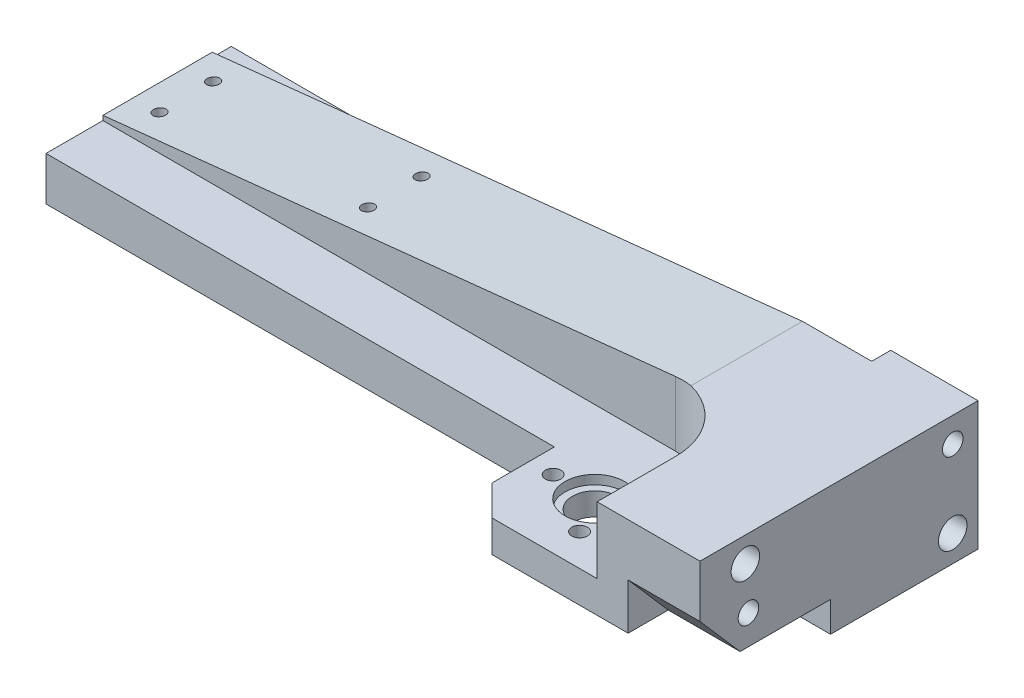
ISO-10303-21;
HEADER;
FILE_DESCRIPTION(('STEP AP214'),'2;1');
FILE_NAME('part.step','',(''),(''),'','','');
FILE_SCHEMA(('AUTOMOTIVE_DESIGN { 1 0 10303 214 1 1 1 1 }'));
ENDSEC;
DATA;
#1=APPLICATION_CONTEXT('core data for automotive mechanical design processes');
#2=APPLICATION_PROTOCOL_DEFINITION('international standard','automotive_design',2000,#1);
#3=PRODUCT_CONTEXT('',#1,'mechanical');
#4=PRODUCT('Part','Part','',(#3));
#5=PRODUCT_RELATED_PRODUCT_CATEGORY('part','',(#4));
#6=PRODUCT_DEFINITION_FORMATION('','',#4);
#7=PRODUCT_DEFINITION_CONTEXT('part definition',#1,'design');
#8=PRODUCT_DEFINITION('design','',#6,#7);
#9=PRODUCT_DEFINITION_SHAPE('','',#8);
#10=(LENGTH_UNIT() NAMED_UNIT(*) SI_UNIT(.MILLI.,.METRE.));
#11=(NAMED_UNIT(*) PLANE_ANGLE_UNIT() SI_UNIT($,.RADIAN.));
#12=(NAMED_UNIT(*) SI_UNIT($,.STERADIAN.) SOLID_ANGLE_UNIT());
#13=UNCERTAINTY_MEASURE_WITH_UNIT(LENGTH_MEASURE(1.E-05),#10,'distance_accuracy_value','');
#14=(GEOMETRIC_REPRESENTATION_CONTEXT(3) GLOBAL_UNCERTAINTY_ASSIGNED_CONTEXT((#13)) GLOBAL_UNIT_ASSIGNED_CONTEXT((#10,
#11,#12)) REPRESENTATION_CONTEXT('',''));
#15=CARTESIAN_POINT('',(0.,0.,0.));
#16=DIRECTION('',(0.,0.,1.));
#17=DIRECTION('',(1.,0.,0.));
#18=AXIS2_PLACEMENT_3D('',#15,#16,#17);
#19=CARTESIAN_POINT('',(-125.349,-1.016,-4.13131000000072));
#20=DIRECTION('',(0.,0.,-1.));
#21=DIRECTION('',(-1.,0.,0.));
#22=AXIS2_PLACEMENT_3D('',#19,#20,#21);
#23=PLANE('',#22);
#24=DIRECTION('',(0.,1.,0.));
#25=VECTOR('',#24,1.);
#26=CARTESIAN_POINT('',(-40.005,-6.35000000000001,-4.13131000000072));
#27=LINE('',#26,#25);
#28=CARTESIAN_POINT('',(-40.005,-8.3650001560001,-4.13131000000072));
#29=VERTEX_POINT('',#28);
#30=CARTESIAN_POINT('',(-40.005,-6.35000000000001,-4.13131000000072));
#31=VERTEX_POINT('',#30);
#32=EDGE_CURVE('E58',#29,#31,#27,.T.);
#33=ORIENTED_EDGE('',*,*,#32,.T.);
#34=DIRECTION('',(0.,1.,0.));
#35=VECTOR('',#34,1.);
#36=CARTESIAN_POINT('',(-40.005,-6.35,-4.13131000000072));
#37=LINE('',#36,#35);
#38=CARTESIAN_POINT('',(-40.005,-1.01600000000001,-4.13131000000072));
#39=VERTEX_POINT('',#38);
#40=EDGE_CURVE('E267',#31,#39,#37,.T.);
#41=ORIENTED_EDGE('',*,*,#40,.T.);
#42=DIRECTION('',(1.,0.,0.));
#43=VECTOR('',#42,1.);
#44=CARTESIAN_POINT('',(-125.349,-1.016,-4.13131000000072));
#45=LINE('',#44,#43);
#46=CARTESIAN_POINT('',(-125.349,-1.016,-4.13131000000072));
#47=VERTEX_POINT('',#46);
#48=EDGE_CURVE('E258',#47,#39,#45,.T.);
#49=ORIENTED_EDGE('',*,*,#48,.F.);
#50=DIRECTION('',(0.,1.,0.));
#51=VECTOR('',#50,1.);
#52=CARTESIAN_POINT('',(-125.349,-8.36500015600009,-4.13131000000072));
#53=LINE('',#52,#51);
#54=CARTESIAN_POINT('',(-125.349,-8.36500015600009,-4.13131000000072));
#55=VERTEX_POINT('',#54);
#56=EDGE_CURVE('E255',#55,#47,#53,.T.);
#57=ORIENTED_EDGE('',*,*,#56,.F.);
#58=DIRECTION('',(-1.,0.,0.));
#59=VECTOR('',#58,1.);
#60=CARTESIAN_POINT('',(-125.349,-8.36500015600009,-4.13131000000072));
#61=LINE('',#60,#59);
#62=EDGE_CURVE('E261',#29,#55,#61,.T.);
#63=ORIENTED_EDGE('',*,*,#62,.F.);
#64=EDGE_LOOP('',(#33,#41,#49,#57,#63));
#65=FACE_BOUND('',#64,.T.);
#66=ADVANCED_FACE('F36',(#65),#23,.F.);
#67=CARTESIAN_POINT('',(-125.349,-1.016,-10.4813100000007));
#68=DIRECTION('',(0.,0.,-1.));
#69=DIRECTION('',(-1.,0.,0.));
#70=AXIS2_PLACEMENT_3D('',#67,#68,#69);
#71=PLANE('',#70);
#72=DIRECTION('',(-1.,0.,0.));
#73=VECTOR('',#72,1.);
#74=CARTESIAN_POINT('',(-125.349,-6.34999999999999,-10.4813100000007));
#75=LINE('',#74,#73);
#76=CARTESIAN_POINT('',(-40.005,-6.35000000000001,-10.4813100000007));
#77=VERTEX_POINT('',#76);
#78=CARTESIAN_POINT('',(-125.349,-6.35,-10.4813100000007));
#79=VERTEX_POINT('',#78);
#80=EDGE_CURVE('E295',#77,#79,#75,.T.);
#81=ORIENTED_EDGE('',*,*,#80,.F.);
#82=DIRECTION('',(0.,-1.,0.));
#83=VECTOR('',#82,1.);
#84=CARTESIAN_POINT('',(-40.005,-6.35000000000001,-10.4813100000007));
#85=LINE('',#84,#83);
#86=CARTESIAN_POINT('',(-40.005,-8.3650001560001,-10.4813100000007));
#87=VERTEX_POINT('',#86);
#88=EDGE_CURVE('E446',#77,#87,#85,.T.);
#89=ORIENTED_EDGE('',*,*,#88,.T.);
#90=DIRECTION('',(-1.,0.,0.));
#91=VECTOR('',#90,1.);
#92=CARTESIAN_POINT('',(-125.349,-8.36500015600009,-10.4813100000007));
#93=LINE('',#92,#91);
#94=CARTESIAN_POINT('',(-125.349,-8.36500015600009,-10.4813100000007));
#95=VERTEX_POINT('',#94);
#96=EDGE_CURVE('E253',#87,#95,#93,.T.);
#97=ORIENTED_EDGE('',*,*,#96,.T.);
#98=DIRECTION('',(0.,1.,0.));
#99=VECTOR('',#98,1.);
#100=CARTESIAN_POINT('',(-125.349,-8.36500015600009,-10.4813100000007));
#101=LINE('',#100,#99);
#102=EDGE_CURVE('E248',#95,#79,#101,.T.);
#103=ORIENTED_EDGE('',*,*,#102,.T.);
#104=EDGE_LOOP('',(#81,#89,#97,#103));
#105=FACE_BOUND('',#104,.T.);
#106=ADVANCED_FACE('F512',(#105),#71,.T.);
#107=CARTESIAN_POINT('',(-125.349,-8.36500015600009,-4.13131000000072));
#108=DIRECTION('',(0.,-1.,0.));
#109=DIRECTION('',(1.,0.,0.));
#110=AXIS2_PLACEMENT_3D('',#107,#108,#109);
#111=PLANE('',#110);
#112=ORIENTED_EDGE('',*,*,#96,.F.);
#113=DIRECTION('',(0.,0.,1.));
#114=VECTOR('',#113,1.);
#115=CARTESIAN_POINT('',(-40.005,-8.3650001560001,-10.4813100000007));
#116=LINE('',#115,#114);
#117=EDGE_CURVE('E506',#87,#29,#116,.T.);
#118=ORIENTED_EDGE('',*,*,#117,.T.);
#119=ORIENTED_EDGE('',*,*,#62,.T.);
#120=DIRECTION('',(0.,0.,-1.));
#121=VECTOR('',#120,1.);
#122=CARTESIAN_POINT('',(-125.349,-8.36500015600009,-4.13131000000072));
#123=LINE('',#122,#121);
#124=EDGE_CURVE('E264',#55,#95,#123,.T.);
#125=ORIENTED_EDGE('',*,*,#124,.T.);
#126=EDGE_LOOP('',(#112,#118,#119,#125));
#127=FACE_BOUND('',#126,.T.);
#128=ADVANCED_FACE('F514',(#127),#111,.T.);
#129=CARTESIAN_POINT('',(-29.083,-6.35,0.));
#130=DIRECTION('',(0.,1.,0.));
#131=DIRECTION('',(0.,0.,1.));
#132=AXIS2_PLACEMENT_3D('',#129,#130,#131);
#133=CYLINDRICAL_SURFACE('',#132,3.77063);
#134=CARTESIAN_POINT('',(-29.083,-6.35,0.));
#135=DIRECTION('',(0.,1.,0.));
#136=DIRECTION('',(0.,0.,1.));
#137=AXIS2_PLACEMENT_3D('',#134,#135,#136);
#138=CIRCLE('',#137,3.77063);
#139=CARTESIAN_POINT('',(-29.083,-6.35,3.77063));
#140=VERTEX_POINT('',#139);
#141=EDGE_CURVE('E577',#140,#140,#138,.T.);
#142=ORIENTED_EDGE('',*,*,#141,.F.);
#143=EDGE_LOOP('',(#142));
#144=FACE_BOUND('',#143,.T.);
#145=CARTESIAN_POINT('',(-29.083,-2.54,0.));
#146=DIRECTION('',(0.,1.,0.));
#147=DIRECTION('',(-1.,0.,0.));
#148=AXIS2_PLACEMENT_3D('',#145,#146,#147);
#149=CIRCLE('',#148,3.77063);
#150=CARTESIAN_POINT('',(-32.85363,-2.54,0.));
#151=VERTEX_POINT('',#150);
#152=EDGE_CURVE('E432',#151,#151,#149,.F.);
#153=ORIENTED_EDGE('',*,*,#152,.F.);
#154=EDGE_LOOP('',(#153));
#155=FACE_BOUND('',#154,.T.);
#156=ADVANCED_FACE('F647',(#144,#155),#133,.F.);
#157=CARTESIAN_POINT('',(-40.005,-6.35,11.43));
#158=DIRECTION('',(1.,0.,0.));
#159=DIRECTION('',(0.,0.,-1.));
#160=AXIS2_PLACEMENT_3D('',#157,#158,#159);
#161=PLANE('',#160);
#162=ORIENTED_EDGE('',*,*,#40,.F.);
#163=DIRECTION('',(0.,0.,-1.));
#164=VECTOR('',#163,1.);
#165=CARTESIAN_POINT('',(-40.005,-6.35,11.43));
#166=LINE('',#165,#164);
#167=CARTESIAN_POINT('',(-40.005,-6.35,6.34999999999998));
#168=VERTEX_POINT('',#167);
#169=EDGE_CURVE('E397',#168,#31,#166,.T.);
#170=ORIENTED_EDGE('',*,*,#169,.F.);
#171=DIRECTION('',(0.,1.,0.));
#172=VECTOR('',#171,1.);
#173=CARTESIAN_POINT('',(-40.005,-6.35,6.34999999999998));
#174=LINE('',#173,#172);
#175=CARTESIAN_POINT('',(-40.005,-1.016,6.34999999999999));
#176=VERTEX_POINT('',#175);
#177=EDGE_CURVE('E412',#168,#176,#174,.T.);
#178=ORIENTED_EDGE('',*,*,#177,.T.);
#179=DIRECTION('',(0.,0.,-1.));
#180=VECTOR('',#179,1.);
#181=CARTESIAN_POINT('',(-40.005,-1.016,11.43));
#182=LINE('',#181,#180);
#183=EDGE_CURVE('E316',#176,#39,#182,.T.);
#184=ORIENTED_EDGE('',*,*,#183,.T.);
#185=EDGE_LOOP('',(#162,#170,#178,#184));
#186=FACE_BOUND('',#185,.T.);
#187=ADVANCED_FACE('F38',(#186),#161,.F.);
#188=CARTESIAN_POINT('',(0.,-6.34999999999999,11.43));
#189=DIRECTION('',(0.,1.,0.));
#190=DIRECTION('',(-1.,0.,0.));
#191=AXIS2_PLACEMENT_3D('',#188,#189,#190);
#192=PLANE('',#191);
#193=ORIENTED_EDGE('',*,*,#169,.T.);
#194=DIRECTION('',(0.,0.,-1.));
#195=VECTOR('',#194,1.);
#196=CARTESIAN_POINT('',(-40.005,-6.35000000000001,-10.4813100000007));
#197=LINE('',#196,#195);
#198=EDGE_CURVE('E442',#31,#77,#197,.T.);
#199=ORIENTED_EDGE('',*,*,#198,.T.);
#200=ORIENTED_EDGE('',*,*,#80,.T.);
#201=DIRECTION('',(0.,0.,1.));
#202=VECTOR('',#201,1.);
#203=CARTESIAN_POINT('',(-125.349,-6.34999999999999,-35.2386900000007));
#204=LINE('',#203,#202);
#205=CARTESIAN_POINT('',(-125.349,-6.34999999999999,-35.2386900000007));
#206=VERTEX_POINT('',#205);
#207=EDGE_CURVE('E333',#206,#79,#204,.T.);
#208=ORIENTED_EDGE('',*,*,#207,.F.);
#209=DIRECTION('',(1.,0.,0.));
#210=VECTOR('',#209,1.);
#211=CARTESIAN_POINT('',(-33.02,-6.34999999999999,-35.2386900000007));
#212=LINE('',#211,#210);
#213=CARTESIAN_POINT('',(-33.02,-6.34999999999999,-35.2386900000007));
#214=VERTEX_POINT('',#213);
#215=EDGE_CURVE('E336',#206,#214,#212,.T.);
#216=ORIENTED_EDGE('',*,*,#215,.T.);
#217=DIRECTION('',(0.,0.,-1.));
#218=VECTOR('',#217,1.);
#219=CARTESIAN_POINT('',(-33.02,-6.35,-16.383));
#220=LINE('',#219,#218);
#221=CARTESIAN_POINT('',(-33.02,-6.35,-10.4813100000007));
#222=VERTEX_POINT('',#221);
#223=EDGE_CURVE('E389',#222,#214,#220,.T.);
#224=ORIENTED_EDGE('',*,*,#223,.F.);
#225=DIRECTION('',(-1.,0.,0.));
#226=VECTOR('',#225,1.);
#227=CARTESIAN_POINT('',(0.,-6.34999999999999,-10.4813100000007));
#228=LINE('',#227,#226);
#229=CARTESIAN_POINT('',(0.,-6.34999999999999,-10.4813100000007));
#230=VERTEX_POINT('',#229);
#231=EDGE_CURVE('E383',#230,#222,#228,.T.);
#232=ORIENTED_EDGE('',*,*,#231,.F.);
#233=DIRECTION('',(0.,0.,-1.));
#234=VECTOR('',#233,1.);
#235=CARTESIAN_POINT('',(0.,-6.34999999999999,11.43));
#236=LINE('',#235,#234);
#237=CARTESIAN_POINT('',(0.,-6.34999999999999,4.699));
#238=VERTEX_POINT('',#237);
#239=EDGE_CURVE('E394',#238,#230,#236,.T.);
#240=ORIENTED_EDGE('',*,*,#239,.F.);
#241=DIRECTION('',(1.,0.,0.));
#242=VECTOR('',#241,1.);
#243=CARTESIAN_POINT('',(-12.065,-6.35,4.699));
#244=LINE('',#243,#242);
#245=CARTESIAN_POINT('',(-12.065,-6.35,4.699));
#246=VERTEX_POINT('',#245);
#247=EDGE_CURVE('E306',#246,#238,#244,.T.);
#248=ORIENTED_EDGE('',*,*,#247,.F.);
#249=DIRECTION('',(0.,0.,-1.));
#250=VECTOR('',#249,1.);
#251=CARTESIAN_POINT('',(-12.065,-6.35,11.43));
#252=LINE('',#251,#250);
#253=CARTESIAN_POINT('',(-12.065,-6.35,11.43));
#254=VERTEX_POINT('',#253);
#255=EDGE_CURVE('E302',#254,#246,#252,.T.);
#256=ORIENTED_EDGE('',*,*,#255,.F.);
#257=DIRECTION('',(1.,0.,0.));
#258=VECTOR('',#257,1.);
#259=CARTESIAN_POINT('',(0.,-6.34999999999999,11.43));
#260=LINE('',#259,#258);
#261=CARTESIAN_POINT('',(-34.925,-6.35,11.43));
#262=VERTEX_POINT('',#261);
#263=EDGE_CURVE('E546',#262,#254,#260,.T.);
#264=ORIENTED_EDGE('',*,*,#263,.F.);
#265=DIRECTION('',(0.707106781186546,0.,0.707106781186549));
#266=VECTOR('',#265,1.);
#267=CARTESIAN_POINT('',(-34.925,-6.35,11.43));
#268=LINE('',#267,#266);
#269=EDGE_CURVE('E410',#262,#168,#268,.F.);
#270=ORIENTED_EDGE('',*,*,#269,.T.);
#271=EDGE_LOOP('',(#193,#199,#200,#208,#216,#224,#232,#240,#248,#256,#264,#270));
#272=FACE_BOUND('',#271,.T.);
#273=ORIENTED_EDGE('',*,*,#141,.T.);
#274=EDGE_LOOP('',(#273));
#275=FACE_BOUND('',#274,.T.);
#276=CARTESIAN_POINT('',(-25.5828800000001,-6.35,-6.06238567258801));
#277=DIRECTION('',(0.,-1.,0.));
#278=DIRECTION('',(0.,0.,-1.));
#279=AXIS2_PLACEMENT_3D('',#276,#277,#278);
#280=CIRCLE('',#279,2.3);
#281=CARTESIAN_POINT('',(-25.5828800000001,-6.35,-8.36238567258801));
#282=VERTEX_POINT('',#281);
#283=EDGE_CURVE('E568',#282,#282,#280,.T.);
#284=ORIENTED_EDGE('',*,*,#283,.F.);
#285=EDGE_LOOP('',(#284));
#286=FACE_BOUND('',#285,.T.);
#287=CARTESIAN_POINT('',(-25.58288,-6.35,6.06238567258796));
#288=DIRECTION('',(0.,-1.,0.));
#289=DIRECTION('',(0.,0.,-1.));
#290=AXIS2_PLACEMENT_3D('',#287,#288,#289);
#291=CIRCLE('',#290,2.3);
#292=CARTESIAN_POINT('',(-25.58288,-6.35,3.76238567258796));
#293=VERTEX_POINT('',#292);
#294=EDGE_CURVE('E559',#293,#293,#291,.T.);
#295=ORIENTED_EDGE('',*,*,#294,.F.);
#296=EDGE_LOOP('',(#295));
#297=FACE_BOUND('',#296,.T.);
#298=CARTESIAN_POINT('',(-36.08324,-6.35,0.));
#299=DIRECTION('',(0.,-1.,0.));
#300=DIRECTION('',(0.,0.,-1.));
#301=AXIS2_PLACEMENT_3D('',#298,#299,#300);
#302=CIRCLE('',#301,2.3);
#303=CARTESIAN_POINT('',(-36.08324,-6.35,-2.3));
#304=VERTEX_POINT('',#303);
#305=EDGE_CURVE('E549',#304,#304,#302,.T.);
#306=ORIENTED_EDGE('',*,*,#305,.F.);
#307=EDGE_LOOP('',(#306));
#308=FACE_BOUND('',#307,.T.);
#309=CARTESIAN_POINT('',(-85.52,-6.35000000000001,-27.3600000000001));
#310=DIRECTION('',(0.,-1.,0.));
#311=DIRECTION('',(0.,0.,-1.));
#312=AXIS2_PLACEMENT_3D('',#309,#310,#311);
#313=CIRCLE('',#312,1.02499999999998);
#314=CARTESIAN_POINT('',(-85.52,-6.35000000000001,-28.3850000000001));
#315=VERTEX_POINT('',#314);
#316=EDGE_CURVE('E292',#315,#315,#313,.T.);
#317=ORIENTED_EDGE('',*,*,#316,.F.);
#318=EDGE_LOOP('',(#317));
#319=FACE_BOUND('',#318,.T.);
#320=CARTESIAN_POINT('',(-85.52,-6.35000000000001,-18.3600000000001));
#321=DIRECTION('',(0.,-1.,0.));
#322=DIRECTION('',(0.,0.,-1.));
#323=AXIS2_PLACEMENT_3D('',#320,#321,#322);
#324=CIRCLE('',#323,1.02499999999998);
#325=CARTESIAN_POINT('',(-85.52,-6.35000000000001,-19.3850000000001));
#326=VERTEX_POINT('',#325);
#327=EDGE_CURVE('E289',#326,#326,#324,.T.);
#328=ORIENTED_EDGE('',*,*,#327,.F.);
#329=EDGE_LOOP('',(#328));
#330=FACE_BOUND('',#329,.T.);
#331=CARTESIAN_POINT('',(-120.52,-6.35000000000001,-18.3600000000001));
#332=DIRECTION('',(0.,-1.,0.));
#333=DIRECTION('',(0.,0.,-1.));
#334=AXIS2_PLACEMENT_3D('',#331,#332,#333);
#335=CIRCLE('',#334,1.02499999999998);
#336=CARTESIAN_POINT('',(-120.52,-6.35000000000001,-19.3850000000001));
#337=VERTEX_POINT('',#336);
#338=EDGE_CURVE('E286',#337,#337,#335,.T.);
#339=ORIENTED_EDGE('',*,*,#338,.F.);
#340=EDGE_LOOP('',(#339));
#341=FACE_BOUND('',#340,.T.);
#342=CARTESIAN_POINT('',(-120.52,-6.35000000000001,-27.3600000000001));
#343=DIRECTION('',(0.,-1.,0.));
#344=DIRECTION('',(0.,0.,-1.));
#345=AXIS2_PLACEMENT_3D('',#342,#343,#344);
#346=CIRCLE('',#345,1.02499999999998);
#347=CARTESIAN_POINT('',(-120.52,-6.35000000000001,-28.3850000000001));
#348=VERTEX_POINT('',#347);
#349=EDGE_CURVE('E283',#348,#348,#346,.T.);
#350=ORIENTED_EDGE('',*,*,#349,.F.);
#351=EDGE_LOOP('',(#350));
#352=FACE_BOUND('',#351,.T.);
#353=CARTESIAN_POINT('',(-50.52,-6.35,-27.3600000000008));
#354=DIRECTION('',(0.,-1.,0.));
#355=DIRECTION('',(0.,0.,-1.));
#356=AXIS2_PLACEMENT_3D('',#353,#354,#355);
#357=CIRCLE('',#356,1.02499999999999);
#358=CARTESIAN_POINT('',(-50.52,-6.35,-28.3850000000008));
#359=VERTEX_POINT('',#358);
#360=EDGE_CURVE('E280',#359,#359,#357,.T.);
#361=ORIENTED_EDGE('',*,*,#360,.F.);
#362=EDGE_LOOP('',(#361));
#363=FACE_BOUND('',#362,.T.);
#364=CARTESIAN_POINT('',(-50.52,-6.35,-18.3600000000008));
#365=DIRECTION('',(0.,-1.,0.));
#366=DIRECTION('',(0.,0.,-1.));
#367=AXIS2_PLACEMENT_3D('',#364,#365,#366);
#368=CIRCLE('',#367,1.02499999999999);
#369=CARTESIAN_POINT('',(-50.52,-6.35,-19.3850000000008));
#370=VERTEX_POINT('',#369);
#371=EDGE_CURVE('E274',#370,#370,#368,.T.);
#372=ORIENTED_EDGE('',*,*,#371,.F.);
#373=EDGE_LOOP('',(#372));
#374=FACE_BOUND('',#373,.T.);
#375=ADVANCED_FACE('F522',(#272,#275,#286,#297,#308,#319,#330,#341,#352,#363,#374),#192,.F.);
#376=CARTESIAN_POINT('',(-17.272,10.16,-12.1769347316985));
#377=DIRECTION('',(1.,0.,0.));
#378=DIRECTION('',(0.,1.,0.));
#379=AXIS2_PLACEMENT_3D('',#376,#377,#378);
#380=PLANE('',#379);
#381=DIRECTION('',(0.,0.,1.));
#382=VECTOR('',#381,1.);
#383=CARTESIAN_POINT('',(-17.272,10.16,-12.1769347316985));
#384=LINE('',#383,#382);
#385=CARTESIAN_POINT('',(-17.272,10.16,-1.74371000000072));
#386=VERTEX_POINT('',#385);
#387=CARTESIAN_POINT('',(-17.272,10.16,11.43));
#388=VERTEX_POINT('',#387);
#389=EDGE_CURVE('E363',#386,#388,#384,.T.);
#390=ORIENTED_EDGE('',*,*,#389,.F.);
#391=DIRECTION('',(0.,1.,0.));
#392=VECTOR('',#391,1.);
#393=CARTESIAN_POINT('',(-17.272,-1.016,-1.74371000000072));
#394=LINE('',#393,#392);
#395=CARTESIAN_POINT('',(-17.272,-1.016,-1.74371000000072));
#396=VERTEX_POINT('',#395);
#397=EDGE_CURVE('E419',#386,#396,#394,.F.);
#398=ORIENTED_EDGE('',*,*,#397,.T.);
#399=DIRECTION('',(0.,0.,1.));
#400=VECTOR('',#399,1.);
#401=CARTESIAN_POINT('',(-17.272,-1.016,-12.1769347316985));
#402=LINE('',#401,#400);
#403=CARTESIAN_POINT('',(-17.272,-1.016,11.43));
#404=VERTEX_POINT('',#403);
#405=EDGE_CURVE('E314',#396,#404,#402,.T.);
#406=ORIENTED_EDGE('',*,*,#405,.T.);
#407=DIRECTION('',(0.,-1.,0.));
#408=VECTOR('',#407,1.);
#409=CARTESIAN_POINT('',(-17.272,0.,11.43));
#410=LINE('',#409,#408);
#411=EDGE_CURVE('E365',#388,#404,#410,.T.);
#412=ORIENTED_EDGE('',*,*,#411,.F.);
#413=EDGE_LOOP('',(#390,#398,#406,#412));
#414=FACE_BOUND('',#413,.T.);
#415=ADVANCED_FACE('F618',(#414),#380,.F.);
#416=CARTESIAN_POINT('',(0.,-1.016,11.43));
#417=DIRECTION('',(0.,1.,0.));
#418=DIRECTION('',(-1.,0.,0.));
#419=AXIS2_PLACEMENT_3D('',#416,#417,#418);
#420=PLANE('',#419);
#421=ORIENTED_EDGE('',*,*,#405,.F.);
#422=CARTESIAN_POINT('',(-29.21,-1.016,-1.74371000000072));
#423=DIRECTION('',(0.,1.,0.));
#424=DIRECTION('',(-1.,0.,0.));
#425=AXIS2_PLACEMENT_3D('',#422,#423,#424);
#426=CIRCLE('',#425,11.938);
#427=CARTESIAN_POINT('',(-29.21,-1.016,-13.6817100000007));
#428=VERTEX_POINT('',#427);
#429=EDGE_CURVE('E421',#396,#428,#426,.T.);
#430=ORIENTED_EDGE('',*,*,#429,.T.);
#431=DIRECTION('',(1.,0.,0.));
#432=VECTOR('',#431,1.);
#433=CARTESIAN_POINT('',(-17.272,-1.016,-13.6817100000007));
#434=LINE('',#433,#432);
#435=CARTESIAN_POINT('',(-125.349,-1.016,-13.6817100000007));
#436=VERTEX_POINT('',#435);
#437=EDGE_CURVE('E472',#436,#428,#434,.T.);
#438=ORIENTED_EDGE('',*,*,#437,.F.);
#439=DIRECTION('',(0.,0.,-1.));
#440=VECTOR('',#439,1.);
#441=CARTESIAN_POINT('',(-125.349,-1.016,-4.13131000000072));
#442=LINE('',#441,#440);
#443=EDGE_CURVE('E263',#47,#436,#442,.T.);
#444=ORIENTED_EDGE('',*,*,#443,.F.);
#445=ORIENTED_EDGE('',*,*,#48,.T.);
#446=ORIENTED_EDGE('',*,*,#183,.F.);
#447=DIRECTION('',(-0.707106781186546,0.,-0.707106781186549));
#448=VECTOR('',#447,1.);
#449=CARTESIAN_POINT('',(-17.4625000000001,-1.016,28.8925));
#450=LINE('',#449,#448);
#451=CARTESIAN_POINT('',(-34.925,-1.016,11.43));
#452=VERTEX_POINT('',#451);
#453=EDGE_CURVE('E414',#176,#452,#450,.F.);
#454=ORIENTED_EDGE('',*,*,#453,.T.);
#455=DIRECTION('',(-1.,0.,0.));
#456=VECTOR('',#455,1.);
#457=CARTESIAN_POINT('',(-40.005,-1.016,11.43));
#458=LINE('',#457,#456);
#459=EDGE_CURVE('E310',#404,#452,#458,.T.);
#460=ORIENTED_EDGE('',*,*,#459,.F.);
#461=EDGE_LOOP('',(#421,#430,#438,#444,#445,#446,#454,#460));
#462=FACE_BOUND('',#461,.T.);
#463=CARTESIAN_POINT('',(-29.083,-1.016,0.));
#464=DIRECTION('',(0.,1.,0.));
#465=DIRECTION('',(-1.,0.,0.));
#466=AXIS2_PLACEMENT_3D('',#463,#464,#465);
#467=CIRCLE('',#466,5.0038);
#468=CARTESIAN_POINT('',(-29.083,-1.016,5.0038));
#469=VERTEX_POINT('',#468);
#470=EDGE_CURVE('E328',#469,#469,#467,.F.);
#471=ORIENTED_EDGE('',*,*,#470,.T.);
#472=EDGE_LOOP('',(#471));
#473=FACE_BOUND('',#472,.T.);
#474=CARTESIAN_POINT('',(-25.58288,-1.016,6.06238567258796));
#475=DIRECTION('',(0.,1.,0.));
#476=DIRECTION('',(-1.,0.,0.));
#477=AXIS2_PLACEMENT_3D('',#474,#475,#476);
#478=CIRCLE('',#477,1.3);
#479=CARTESIAN_POINT('',(-26.88288,-1.016,6.06238567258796));
#480=VERTEX_POINT('',#479);
#481=EDGE_CURVE('E322',#480,#480,#478,.F.);
#482=ORIENTED_EDGE('',*,*,#481,.T.);
#483=EDGE_LOOP('',(#482));
#484=FACE_BOUND('',#483,.T.);
#485=CARTESIAN_POINT('',(-25.5828800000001,-1.016,-6.06238567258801));
#486=DIRECTION('',(0.,1.,0.));
#487=DIRECTION('',(-1.,0.,0.));
#488=AXIS2_PLACEMENT_3D('',#485,#486,#487);
#489=CIRCLE('',#488,1.3);
#490=CARTESIAN_POINT('',(-26.8828800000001,-1.016,-6.06238567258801));
#491=VERTEX_POINT('',#490);
#492=EDGE_CURVE('E319',#491,#491,#489,.F.);
#493=ORIENTED_EDGE('',*,*,#492,.T.);
#494=EDGE_LOOP('',(#493));
#495=FACE_BOUND('',#494,.T.);
#496=CARTESIAN_POINT('',(-36.08324,-1.016,0.));
#497=DIRECTION('',(0.,1.,0.));
#498=DIRECTION('',(-1.,0.,0.));
#499=AXIS2_PLACEMENT_3D('',#496,#497,#498);
#500=CIRCLE('',#499,1.3);
#501=CARTESIAN_POINT('',(-37.38324,-1.016,0.));
#502=VERTEX_POINT('',#501);
#503=EDGE_CURVE('E325',#502,#502,#500,.F.);
#504=ORIENTED_EDGE('',*,*,#503,.T.);
#505=EDGE_LOOP('',(#504));
#506=FACE_BOUND('',#505,.T.);
#507=ADVANCED_FACE('F535',(#462,#473,#484,#495,#506),#420,.T.);
#508=CARTESIAN_POINT('',(-29.083,-1.524,0.));
#509=DIRECTION('',(0.,1.,0.));
#510=DIRECTION('',(0.,0.,1.));
#511=AXIS2_PLACEMENT_3D('',#508,#509,#510);
#512=CYLINDRICAL_SURFACE('',#511,5.0038);
#513=CARTESIAN_POINT('',(-29.083,-2.54,0.));
#514=DIRECTION('',(0.,1.,0.));
#515=DIRECTION('',(-1.,0.,0.));
#516=AXIS2_PLACEMENT_3D('',#513,#514,#515);
#517=CIRCLE('',#516,5.0038);
#518=CARTESIAN_POINT('',(-29.083,-2.54,5.0038));
#519=VERTEX_POINT('',#518);
#520=EDGE_CURVE('E435',#519,#519,#517,.T.);
#521=CARTESIAN_POINT('',(-29.083,-1.016,5.0038));
#522=CARTESIAN_POINT('',(-29.083,-1.031875,5.0038));
#523=CARTESIAN_POINT('',(-29.083,-1.04775,5.0038));
#524=CARTESIAN_POINT('',(-29.083,-1.0795,5.0038));
#525=CARTESIAN_POINT('',(-29.083,-1.095375,5.0038));
#526=CARTESIAN_POINT('',(-29.083,-1.127125,5.0038));
#527=CARTESIAN_POINT('',(-29.083,-1.143,5.0038));
#528=CARTESIAN_POINT('',(-29.083,-1.17475,5.0038));
#529=CARTESIAN_POINT('',(-29.083,-1.190625,5.0038));
#530=CARTESIAN_POINT('',(-29.083,-1.222375,5.0038));
#531=CARTESIAN_POINT('',(-29.083,-1.23825,5.0038));
#532=CARTESIAN_POINT('',(-29.083,-1.27,5.0038));
#533=CARTESIAN_POINT('',(-29.083,-1.285875,5.0038));
#534=CARTESIAN_POINT('',(-29.083,-1.317625,5.0038));
#535=CARTESIAN_POINT('',(-29.083,-1.3335,5.0038));
#536=CARTESIAN_POINT('',(-29.083,-1.36525,5.0038));
#537=CARTESIAN_POINT('',(-29.083,-1.381125,5.0038));
#538=CARTESIAN_POINT('',(-29.083,-1.412875,5.0038));
#539=CARTESIAN_POINT('',(-29.083,-1.42875,5.0038));
#540=CARTESIAN_POINT('',(-29.083,-1.4605,5.0038));
#541=CARTESIAN_POINT('',(-29.083,-1.476375,5.0038));
#542=CARTESIAN_POINT('',(-29.083,-1.508125,5.0038));
#543=CARTESIAN_POINT('',(-29.083,-1.524,5.0038));
#544=CARTESIAN_POINT('',(-29.083,-1.55575,5.0038));
#545=CARTESIAN_POINT('',(-29.083,-1.571625,5.0038));
#546=CARTESIAN_POINT('',(-29.083,-1.603375,5.0038));
#547=CARTESIAN_POINT('',(-29.083,-1.61925,5.0038));
#548=CARTESIAN_POINT('',(-29.083,-1.651,5.0038));
#549=CARTESIAN_POINT('',(-29.083,-1.666875,5.0038));
#550=CARTESIAN_POINT('',(-29.083,-1.698625,5.0038));
#551=CARTESIAN_POINT('',(-29.083,-1.7145,5.0038));
#552=CARTESIAN_POINT('',(-29.083,-1.74625,5.0038));
#553=CARTESIAN_POINT('',(-29.083,-1.762125,5.0038));
#554=CARTESIAN_POINT('',(-29.083,-1.793875,5.0038));
#555=CARTESIAN_POINT('',(-29.083,-1.80975,5.0038));
#556=CARTESIAN_POINT('',(-29.083,-1.8415,5.0038));
#557=CARTESIAN_POINT('',(-29.083,-1.857375,5.0038));
#558=CARTESIAN_POINT('',(-29.083,-1.889125,5.0038));
#559=CARTESIAN_POINT('',(-29.083,-1.905,5.0038));
#560=CARTESIAN_POINT('',(-29.083,-1.93675,5.0038));
#561=CARTESIAN_POINT('',(-29.083,-1.952625,5.0038));
#562=CARTESIAN_POINT('',(-29.083,-1.984375,5.0038));
#563=CARTESIAN_POINT('',(-29.083,-2.00025,5.0038));
#564=CARTESIAN_POINT('',(-29.083,-2.032,5.0038));
#565=CARTESIAN_POINT('',(-29.083,-2.047875,5.0038));
#566=CARTESIAN_POINT('',(-29.083,-2.079625,5.0038));
#567=CARTESIAN_POINT('',(-29.083,-2.0955,5.0038));
#568=CARTESIAN_POINT('',(-29.083,-2.12725,5.0038));
#569=CARTESIAN_POINT('',(-29.083,-2.143125,5.0038));
#570=CARTESIAN_POINT('',(-29.083,-2.174875,5.0038));
#571=CARTESIAN_POINT('',(-29.083,-2.19075,5.0038));
#572=CARTESIAN_POINT('',(-29.083,-2.2225,5.0038));
#573=CARTESIAN_POINT('',(-29.083,-2.238375,5.0038));
#574=CARTESIAN_POINT('',(-29.083,-2.270125,5.0038));
#575=CARTESIAN_POINT('',(-29.083,-2.286,5.0038));
#576=CARTESIAN_POINT('',(-29.083,-2.31775,5.0038));
#577=CARTESIAN_POINT('',(-29.083,-2.333625,5.0038));
#578=CARTESIAN_POINT('',(-29.083,-2.365375,5.0038));
#579=CARTESIAN_POINT('',(-29.083,-2.38125,5.0038));
#580=CARTESIAN_POINT('',(-29.083,-2.413,5.0038));
#581=CARTESIAN_POINT('',(-29.083,-2.428875,5.0038));
#582=CARTESIAN_POINT('',(-29.083,-2.460625,5.0038));
#583=CARTESIAN_POINT('',(-29.083,-2.4765,5.0038));
#584=CARTESIAN_POINT('',(-29.083,-2.50825,5.0038));
#585=CARTESIAN_POINT('',(-29.083,-2.524125,5.0038));
#586=CARTESIAN_POINT('',(-29.083,-2.54,5.0038));
#587=B_SPLINE_CURVE_WITH_KNOTS('',3,(#521,#522,#523,#524,#525,#526,#527,#528,#529,#530,#531,
#532,#533,#534,#535,#536,#537,#538,#539,#540,#541,#542,#543,#544,#545,#546,#547,#548,#549,#550,
#551,#552,#553,#554,#555,#556,#557,#558,#559,#560,#561,#562,#563,#564,#565,#566,#567,#568,#569,
#570,#571,#572,#573,#574,#575,#576,#577,#578,#579,#580,#581,#582,#583,#584,#585,#586),
.UNSPECIFIED.,.F.,.F.,(4,2,2,2,2,2,2,2,2,2,2,2,2,2,2,2,2,2,2,2,2,2,2,2,2,2,2,2,2,2,2,2,4),(0.,
0.0476250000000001,0.0952500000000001,0.142875,0.1905,0.238125,0.28575,0.333375,0.381,0.428625,
0.47625,0.523875,0.5715,0.619125,0.66675,0.714375,0.762,0.809625,0.85725,0.904875,0.9525,
1.000125,1.04775,1.095375,1.143,1.190625,1.23825,1.285875,1.3335,1.381125,1.42875,1.476375,
1.524),.UNSPECIFIED.);
#588=EDGE_CURVE('BSEAM692',#469,#519,#587,.T.);
#589=ORIENTED_EDGE('',*,*,#470,.F.);
#590=ORIENTED_EDGE('',*,*,#520,.F.);
#591=ORIENTED_EDGE('',*,*,#588,.T.);
#592=ORIENTED_EDGE('',*,*,#588,.F.);
#593=EDGE_LOOP('',(#589,#591,#590,#592));
#594=FACE_BOUND('',#593,.T.);
#595=ADVANCED_FACE('F692',(#594),#512,.F.);
#596=CARTESIAN_POINT('',(-36.08324,-6.35,0.));
#597=DIRECTION('',(0.,-1.,0.));
#598=DIRECTION('',(0.,0.,-1.));
#599=AXIS2_PLACEMENT_3D('',#596,#597,#598);
#600=CYLINDRICAL_SURFACE('',#599,1.3);
#601=CARTESIAN_POINT('',(-36.08324,-3.85,0.));
#602=DIRECTION('',(0.,-1.,0.));
#603=DIRECTION('',(0.,0.,-1.));
#604=AXIS2_PLACEMENT_3D('',#601,#602,#603);
#605=CIRCLE('',#604,1.3);
#606=CARTESIAN_POINT('',(-36.08324,-3.85,-1.3));
#607=VERTEX_POINT('',#606);
#608=EDGE_CURVE('E556',#607,#607,#605,.T.);
#609=ORIENTED_EDGE('',*,*,#608,.T.);
#610=EDGE_LOOP('',(#609));
#611=FACE_BOUND('',#610,.T.);
#612=ORIENTED_EDGE('',*,*,#503,.F.);
#613=EDGE_LOOP('',(#612));
#614=FACE_BOUND('',#613,.T.);
#615=ADVANCED_FACE('F759',(#611,#614),#600,.F.);
#616=CARTESIAN_POINT('',(-25.58288,-6.35,6.06238567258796));
#617=DIRECTION('',(0.,-1.,0.));
#618=DIRECTION('',(0.,0.,-1.));
#619=AXIS2_PLACEMENT_3D('',#616,#617,#618);
#620=CYLINDRICAL_SURFACE('',#619,1.3);
#621=CARTESIAN_POINT('',(-25.58288,-3.85,6.06238567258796));
#622=DIRECTION('',(0.,-1.,0.));
#623=DIRECTION('',(0.,0.,-1.));
#624=AXIS2_PLACEMENT_3D('',#621,#622,#623);
#625=CIRCLE('',#624,1.3);
#626=CARTESIAN_POINT('',(-25.58288,-3.85,4.76238567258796));
#627=VERTEX_POINT('',#626);
#628=EDGE_CURVE('E565',#627,#627,#625,.T.);
#629=ORIENTED_EDGE('',*,*,#628,.T.);
#630=EDGE_LOOP('',(#629));
#631=FACE_BOUND('',#630,.T.);
#632=ORIENTED_EDGE('',*,*,#481,.F.);
#633=EDGE_LOOP('',(#632));
#634=FACE_BOUND('',#633,.T.);
#635=ADVANCED_FACE('F747',(#631,#634),#620,.F.);
#636=CARTESIAN_POINT('',(-25.5828800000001,-6.35,-6.06238567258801));
#637=DIRECTION('',(0.,-1.,0.));
#638=DIRECTION('',(0.,0.,-1.));
#639=AXIS2_PLACEMENT_3D('',#636,#637,#638);
#640=CYLINDRICAL_SURFACE('',#639,1.3);
#641=CARTESIAN_POINT('',(-25.5828800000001,-3.85,-6.06238567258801));
#642=DIRECTION('',(0.,-1.,0.));
#643=DIRECTION('',(0.,0.,-1.));
#644=AXIS2_PLACEMENT_3D('',#641,#642,#643);
#645=CIRCLE('',#644,1.3);
#646=CARTESIAN_POINT('',(-25.5828800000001,-3.85,-7.36238567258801));
#647=VERTEX_POINT('',#646);
#648=EDGE_CURVE('E574',#647,#647,#645,.T.);
#649=ORIENTED_EDGE('',*,*,#648,.T.);
#650=EDGE_LOOP('',(#649));
#651=FACE_BOUND('',#650,.T.);
#652=ORIENTED_EDGE('',*,*,#492,.F.);
#653=EDGE_LOOP('',(#652));
#654=FACE_BOUND('',#653,.T.);
#655=ADVANCED_FACE('F738',(#651,#654),#640,.F.);
#656=CARTESIAN_POINT('',(-33.02,-11.43,-16.383));
#657=DIRECTION('',(1.,0.,0.));
#658=DIRECTION('',(0.,1.,0.));
#659=AXIS2_PLACEMENT_3D('',#656,#657,#658);
#660=PLANE('',#659);
#661=ORIENTED_EDGE('',*,*,#223,.T.);
#662=DIRECTION('',(0.,-1.,0.));
#663=VECTOR('',#662,1.);
#664=CARTESIAN_POINT('',(-33.02,-11.43,-35.2386900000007));
#665=LINE('',#664,#663);
#666=CARTESIAN_POINT('',(-33.02,-11.43,-35.2386900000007));
#667=VERTEX_POINT('',#666);
#668=EDGE_CURVE('E372',#214,#667,#665,.T.);
#669=ORIENTED_EDGE('',*,*,#668,.T.);
#670=DIRECTION('',(0.,0.,-1.));
#671=VECTOR('',#670,1.);
#672=CARTESIAN_POINT('',(-33.02,-11.43,-16.383));
#673=LINE('',#672,#671);
#674=CARTESIAN_POINT('',(-33.02,-11.43,-10.4813100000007));
#675=VERTEX_POINT('',#674);
#676=EDGE_CURVE('E584',#675,#667,#673,.T.);
#677=ORIENTED_EDGE('',*,*,#676,.F.);
#678=DIRECTION('',(0.,1.,0.));
#679=VECTOR('',#678,1.);
#680=CARTESIAN_POINT('',(-33.02,-11.43,-10.4813100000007));
#681=LINE('',#680,#679);
#682=EDGE_CURVE('E581',#675,#222,#681,.T.);
#683=ORIENTED_EDGE('',*,*,#682,.T.);
#684=EDGE_LOOP('',(#661,#669,#677,#683));
#685=FACE_BOUND('',#684,.T.);
#686=ADVANCED_FACE('F607',(#685),#660,.F.);
#687=CARTESIAN_POINT('',(0.,0.,11.43));
#688=DIRECTION('',(-1.,0.,0.));
#689=DIRECTION('',(0.,-1.,0.));
#690=AXIS2_PLACEMENT_3D('',#687,#688,#689);
#691=PLANE('',#690);
#692=CARTESIAN_POINT('',(0.,5.969,-30.9968900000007));
#693=DIRECTION('',(1.,0.,0.));
#694=DIRECTION('',(0.,0.,-1.));
#695=AXIS2_PLACEMENT_3D('',#692,#693,#694);
#696=CIRCLE('',#695,1.7272);
#697=CARTESIAN_POINT('',(0.,5.969,-32.7240900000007));
#698=VERTEX_POINT('',#697);
#699=EDGE_CURVE('E342',#698,#698,#696,.T.);
#700=ORIENTED_EDGE('',*,*,#699,.F.);
#701=EDGE_LOOP('',(#700));
#702=FACE_BOUND('',#701,.T.);
#703=CARTESIAN_POINT('',(0.,-1.42239999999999,3.29310999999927));
#704=DIRECTION('',(1.,0.,0.));
#705=DIRECTION('',(0.,0.,-1.));
#706=AXIS2_PLACEMENT_3D('',#703,#704,#705);
#707=CIRCLE('',#706,1.7272);
#708=CARTESIAN_POINT('',(0.,-1.42239999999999,1.56590999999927));
#709=VERTEX_POINT('',#708);
#710=EDGE_CURVE('E348',#709,#709,#707,.T.);
#711=ORIENTED_EDGE('',*,*,#710,.F.);
#712=EDGE_LOOP('',(#711));
#713=FACE_BOUND('',#712,.T.);
#714=CARTESIAN_POINT('',(0.,5.969,3.81380999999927));
#715=DIRECTION('',(1.,0.,0.));
#716=DIRECTION('',(0.,0.,-1.));
#717=AXIS2_PLACEMENT_3D('',#714,#715,#716);
#718=CIRCLE('',#717,2.39395);
#719=CARTESIAN_POINT('',(0.,5.969,1.41985999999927));
#720=VERTEX_POINT('',#719);
#721=EDGE_CURVE('E354',#720,#720,#718,.T.);
#722=ORIENTED_EDGE('',*,*,#721,.F.);
#723=EDGE_LOOP('',(#722));
#724=FACE_BOUND('',#723,.T.);
#725=CARTESIAN_POINT('',(0.,-6.98499999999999,-30.9968900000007));
#726=DIRECTION('',(1.,0.,0.));
#727=DIRECTION('',(0.,0.,-1.));
#728=AXIS2_PLACEMENT_3D('',#725,#726,#727);
#729=CIRCLE('',#728,2.39395);
#730=CARTESIAN_POINT('',(0.,-6.98499999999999,-33.3908400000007));
#731=VERTEX_POINT('',#730);
#732=EDGE_CURVE('E360',#731,#731,#729,.T.);
#733=ORIENTED_EDGE('',*,*,#732,.F.);
#734=EDGE_LOOP('',(#733));
#735=FACE_BOUND('',#734,.T.);
#736=DIRECTION('',(0.,1.,0.));
#737=VECTOR('',#736,1.);
#738=CARTESIAN_POINT('',(0.,0.,11.43));
#739=LINE('',#738,#737);
#740=CARTESIAN_POINT('',(0.,1.39312974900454,11.43));
#741=VERTEX_POINT('',#740);
#742=CARTESIAN_POINT('',(0.,10.16,11.43));
#743=VERTEX_POINT('',#742);
#744=EDGE_CURVE('E398',#741,#743,#739,.T.);
#745=ORIENTED_EDGE('',*,*,#744,.F.);
#746=DIRECTION('',(0.,0.754709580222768,0.656059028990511));
#747=VECTOR('',#746,1.);
#748=CARTESIAN_POINT('',(0.,-6.34999999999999,4.699));
#749=LINE('',#748,#747);
#750=EDGE_CURVE('E297',#238,#741,#749,.T.);
#751=ORIENTED_EDGE('',*,*,#750,.F.);
#752=ORIENTED_EDGE('',*,*,#239,.T.);
#753=DIRECTION('',(0.,1.,0.));
#754=VECTOR('',#753,1.);
#755=CARTESIAN_POINT('',(0.,-11.43,-10.4813100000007));
#756=LINE('',#755,#754);
#757=CARTESIAN_POINT('',(0.,-11.43,-10.4813100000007));
#758=VERTEX_POINT('',#757);
#759=EDGE_CURVE('E580',#758,#230,#756,.T.);
#760=ORIENTED_EDGE('',*,*,#759,.F.);
#761=DIRECTION('',(0.,0.,1.));
#762=VECTOR('',#761,1.);
#763=CARTESIAN_POINT('',(0.,-11.43,-16.383));
#764=LINE('',#763,#762);
#765=CARTESIAN_POINT('',(0.,-11.43,-35.2386900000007));
#766=VERTEX_POINT('',#765);
#767=EDGE_CURVE('E386',#766,#758,#764,.T.);
#768=ORIENTED_EDGE('',*,*,#767,.F.);
#769=DIRECTION('',(0.,1.,0.));
#770=VECTOR('',#769,1.);
#771=CARTESIAN_POINT('',(0.,-11.43,-35.2386900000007));
#772=LINE('',#771,#770);
#773=CARTESIAN_POINT('',(0.,10.16,-35.2386900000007));
#774=VERTEX_POINT('',#773);
#775=EDGE_CURVE('E377',#766,#774,#772,.T.);
#776=ORIENTED_EDGE('',*,*,#775,.T.);
#777=DIRECTION('',(0.,0.,-1.));
#778=VECTOR('',#777,1.);
#779=CARTESIAN_POINT('',(0.,10.16,-16.383));
#780=LINE('',#779,#778);
#781=EDGE_CURVE('E380',#743,#774,#780,.T.);
#782=ORIENTED_EDGE('',*,*,#781,.F.);
#783=EDGE_LOOP('',(#745,#751,#752,#760,#768,#776,#782));
#784=FACE_BOUND('',#783,.T.);
#785=ADVANCED_FACE('F597',(#702,#713,#724,#735,#784),#691,.F.);
#786=CARTESIAN_POINT('',(-40.005,0.,11.43));
#787=DIRECTION('',(0.,0.,-1.));
#788=DIRECTION('',(-1.,0.,0.));
#789=AXIS2_PLACEMENT_3D('',#786,#787,#788);
#790=PLANE('',#789);
#791=ORIENTED_EDGE('',*,*,#459,.T.);
#792=DIRECTION('',(0.,-1.,0.));
#793=VECTOR('',#792,1.);
#794=CARTESIAN_POINT('',(-34.925,0.,11.43));
#795=LINE('',#794,#793);
#796=EDGE_CURVE('E399',#452,#262,#795,.T.);
#797=ORIENTED_EDGE('',*,*,#796,.T.);
#798=ORIENTED_EDGE('',*,*,#263,.T.);
#799=DIRECTION('',(0.,-1.,0.));
#800=VECTOR('',#799,1.);
#801=CARTESIAN_POINT('',(-12.065,1.39312974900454,11.43));
#802=LINE('',#801,#800);
#803=CARTESIAN_POINT('',(-12.065,1.39312974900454,11.43));
#804=VERTEX_POINT('',#803);
#805=EDGE_CURVE('E299',#804,#254,#802,.T.);
#806=ORIENTED_EDGE('',*,*,#805,.F.);
#807=DIRECTION('',(1.,0.,0.));
#808=VECTOR('',#807,1.);
#809=CARTESIAN_POINT('',(-12.065,1.39312974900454,11.43));
#810=LINE('',#809,#808);
#811=EDGE_CURVE('E307',#804,#741,#810,.T.);
#812=ORIENTED_EDGE('',*,*,#811,.T.);
#813=ORIENTED_EDGE('',*,*,#744,.T.);
#814=DIRECTION('',(1.,0.,0.));
#815=VECTOR('',#814,1.);
#816=CARTESIAN_POINT('',(-17.272,10.16,11.43));
#817=LINE('',#816,#815);
#818=EDGE_CURVE('E368',#388,#743,#817,.T.);
#819=ORIENTED_EDGE('',*,*,#818,.F.);
#820=ORIENTED_EDGE('',*,*,#411,.T.);
#821=EDGE_LOOP('',(#791,#797,#798,#806,#812,#813,#819,#820));
#822=FACE_BOUND('',#821,.T.);
#823=ADVANCED_FACE('F544',(#822),#790,.F.);
#824=CARTESIAN_POINT('',(-36.08324,-6.35,0.));
#825=DIRECTION('',(0.,-1.,0.));
#826=DIRECTION('',(0.,0.,-1.));
#827=AXIS2_PLACEMENT_3D('',#824,#825,#826);
#828=CYLINDRICAL_SURFACE('',#827,2.3);
#829=CARTESIAN_POINT('',(-36.08324,-3.85,0.));
#830=DIRECTION('',(0.,-1.,0.));
#831=DIRECTION('',(0.,0.,-1.));
#832=AXIS2_PLACEMENT_3D('',#829,#830,#831);
#833=CIRCLE('',#832,2.3);
#834=CARTESIAN_POINT('',(-36.08324,-3.85,-2.3));
#835=VERTEX_POINT('',#834);
#836=EDGE_CURVE('E551',#835,#835,#833,.T.);
#837=ORIENTED_EDGE('',*,*,#836,.F.);
#838=EDGE_LOOP('',(#837));
#839=FACE_BOUND('',#838,.T.);
#840=ORIENTED_EDGE('',*,*,#305,.T.);
#841=EDGE_LOOP('',(#840));
#842=FACE_BOUND('',#841,.T.);
#843=ADVANCED_FACE('F774',(#839,#842),#828,.F.);
#844=CARTESIAN_POINT('',(-34.78324,-3.85,0.));
#845=DIRECTION('',(0.,1.,0.));
#846=DIRECTION('',(0.,0.,1.));
#847=AXIS2_PLACEMENT_3D('',#844,#845,#846);
#848=PLANE('',#847);
#849=ORIENTED_EDGE('',*,*,#608,.F.);
#850=EDGE_LOOP('',(#849));
#851=FACE_BOUND('',#850,.T.);
#852=ORIENTED_EDGE('',*,*,#836,.T.);
#853=EDGE_LOOP('',(#852));
#854=FACE_BOUND('',#853,.T.);
#855=ADVANCED_FACE('F767',(#851,#854),#848,.F.);
#856=CARTESIAN_POINT('',(-25.58288,-6.35,6.06238567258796));
#857=DIRECTION('',(0.,-1.,0.));
#858=DIRECTION('',(0.,0.,-1.));
#859=AXIS2_PLACEMENT_3D('',#856,#857,#858);
#860=CYLINDRICAL_SURFACE('',#859,2.3);
#861=CARTESIAN_POINT('',(-25.58288,-3.85,6.06238567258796));
#862=DIRECTION('',(0.,-1.,0.));
#863=DIRECTION('',(0.,0.,-1.));
#864=AXIS2_PLACEMENT_3D('',#861,#862,#863);
#865=CIRCLE('',#864,2.3);
#866=CARTESIAN_POINT('',(-25.58288,-3.85,3.76238567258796));
#867=VERTEX_POINT('',#866);
#868=EDGE_CURVE('E562',#867,#867,#865,.T.);
#869=ORIENTED_EDGE('',*,*,#868,.F.);
#870=EDGE_LOOP('',(#869));
#871=FACE_BOUND('',#870,.T.);
#872=ORIENTED_EDGE('',*,*,#294,.T.);
#873=EDGE_LOOP('',(#872));
#874=FACE_BOUND('',#873,.T.);
#875=ADVANCED_FACE('F763',(#871,#874),#860,.F.);
#876=CARTESIAN_POINT('',(-24.28288,-3.85,6.06238567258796));
#877=DIRECTION('',(0.,1.,0.));
#878=DIRECTION('',(0.,0.,1.));
#879=AXIS2_PLACEMENT_3D('',#876,#877,#878);
#880=PLANE('',#879);
#881=ORIENTED_EDGE('',*,*,#628,.F.);
#882=EDGE_LOOP('',(#881));
#883=FACE_BOUND('',#882,.T.);
#884=ORIENTED_EDGE('',*,*,#868,.T.);
#885=EDGE_LOOP('',(#884));
#886=FACE_BOUND('',#885,.T.);
#887=ADVANCED_FACE('F755',(#883,#886),#880,.F.);
#888=CARTESIAN_POINT('',(-25.5828800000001,-6.35,-6.06238567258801));
#889=DIRECTION('',(0.,-1.,0.));
#890=DIRECTION('',(0.,0.,-1.));
#891=AXIS2_PLACEMENT_3D('',#888,#889,#890);
#892=CYLINDRICAL_SURFACE('',#891,2.3);
#893=CARTESIAN_POINT('',(-25.5828800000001,-3.85,-6.06238567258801));
#894=DIRECTION('',(0.,-1.,0.));
#895=DIRECTION('',(0.,0.,-1.));
#896=AXIS2_PLACEMENT_3D('',#893,#894,#895);
#897=CIRCLE('',#896,2.3);
#898=CARTESIAN_POINT('',(-25.5828800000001,-3.85,-8.36238567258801));
#899=VERTEX_POINT('',#898);
#900=EDGE_CURVE('E571',#899,#899,#897,.T.);
#901=ORIENTED_EDGE('',*,*,#900,.F.);
#902=EDGE_LOOP('',(#901));
#903=FACE_BOUND('',#902,.T.);
#904=ORIENTED_EDGE('',*,*,#283,.T.);
#905=EDGE_LOOP('',(#904));
#906=FACE_BOUND('',#905,.T.);
#907=ADVANCED_FACE('F751',(#903,#906),#892,.F.);
#908=CARTESIAN_POINT('',(-24.2828800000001,-3.85,-6.06238567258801));
#909=DIRECTION('',(0.,1.,0.));
#910=DIRECTION('',(0.,0.,1.));
#911=AXIS2_PLACEMENT_3D('',#908,#909,#910);
#912=PLANE('',#911);
#913=ORIENTED_EDGE('',*,*,#648,.F.);
#914=EDGE_LOOP('',(#913));
#915=FACE_BOUND('',#914,.T.);
#916=ORIENTED_EDGE('',*,*,#900,.T.);
#917=EDGE_LOOP('',(#916));
#918=FACE_BOUND('',#917,.T.);
#919=ADVANCED_FACE('F741',(#915,#918),#912,.F.);
#920=CARTESIAN_POINT('',(0.,-11.43,-10.4813100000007));
#921=DIRECTION('',(0.,0.,-1.));
#922=DIRECTION('',(-1.,0.,0.));
#923=AXIS2_PLACEMENT_3D('',#920,#921,#922);
#924=PLANE('',#923);
#925=ORIENTED_EDGE('',*,*,#231,.T.);
#926=ORIENTED_EDGE('',*,*,#682,.F.);
#927=DIRECTION('',(-1.,0.,0.));
#928=VECTOR('',#927,1.);
#929=CARTESIAN_POINT('',(0.,-11.43,-10.4813100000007));
#930=LINE('',#929,#928);
#931=EDGE_CURVE('E586',#758,#675,#930,.T.);
#932=ORIENTED_EDGE('',*,*,#931,.F.);
#933=ORIENTED_EDGE('',*,*,#759,.T.);
#934=EDGE_LOOP('',(#925,#926,#932,#933));
#935=FACE_BOUND('',#934,.T.);
#936=ADVANCED_FACE('F604',(#935),#924,.F.);
#937=CARTESIAN_POINT('',(0.,-11.43,-10.4813100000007));
#938=DIRECTION('',(0.,-1.,0.));
#939=DIRECTION('',(1.,0.,0.));
#940=AXIS2_PLACEMENT_3D('',#937,#938,#939);
#941=PLANE('',#940);
#942=ORIENTED_EDGE('',*,*,#767,.T.);
#943=ORIENTED_EDGE('',*,*,#931,.T.);
#944=ORIENTED_EDGE('',*,*,#676,.T.);
#945=DIRECTION('',(1.,0.,0.));
#946=VECTOR('',#945,1.);
#947=CARTESIAN_POINT('',(0.,-11.43,-35.2386900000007));
#948=LINE('',#947,#946);
#949=EDGE_CURVE('E374',#667,#766,#948,.T.);
#950=ORIENTED_EDGE('',*,*,#949,.T.);
#951=EDGE_LOOP('',(#942,#943,#944,#950));
#952=FACE_BOUND('',#951,.T.);
#953=ADVANCED_FACE('F591',(#952),#941,.T.);
#954=CARTESIAN_POINT('',(0.,10.16,-12.1769347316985));
#955=DIRECTION('',(0.,-1.,0.));
#956=DIRECTION('',(0.,0.,-1.));
#957=AXIS2_PLACEMENT_3D('',#954,#955,#956);
#958=PLANE('',#957);
#959=DIRECTION('',(1.,0.,0.));
#960=VECTOR('',#959,1.);
#961=CARTESIAN_POINT('',(-40.005,10.16,-32.0382900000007));
#962=LINE('',#961,#960);
#963=CARTESIAN_POINT('',(-26.2664085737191,10.16,-32.0382900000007));
#964=VERTEX_POINT('',#963);
#965=CARTESIAN_POINT('',(-14.6499761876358,10.16,-32.0382900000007));
#966=VERTEX_POINT('',#965);
#967=EDGE_CURVE('E230',#964,#966,#962,.T.);
#968=ORIENTED_EDGE('',*,*,#967,.F.);
#969=DIRECTION('',(0.,0.,-1.));
#970=VECTOR('',#969,1.);
#971=CARTESIAN_POINT('',(-26.2664085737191,10.16,11.43));
#972=LINE('',#971,#970);
#973=CARTESIAN_POINT('',(-26.2664085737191,10.16,-13.313114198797));
#974=VERTEX_POINT('',#973);
#975=EDGE_CURVE('E215',#974,#964,#972,.T.);
#976=ORIENTED_EDGE('',*,*,#975,.F.);
#977=CARTESIAN_POINT('',(-29.21,10.16,-1.74371000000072));
#978=DIRECTION('',(0.,-1.,0.));
#979=DIRECTION('',(0.,0.,-1.));
#980=AXIS2_PLACEMENT_3D('',#977,#978,#979);
#981=CIRCLE('',#980,11.938);
#982=EDGE_CURVE('E423',#974,#386,#981,.T.);
#983=ORIENTED_EDGE('',*,*,#982,.T.);
#984=ORIENTED_EDGE('',*,*,#389,.T.);
#985=ORIENTED_EDGE('',*,*,#818,.T.);
#986=ORIENTED_EDGE('',*,*,#781,.T.);
#987=DIRECTION('',(-1.,0.,0.));
#988=VECTOR('',#987,1.);
#989=CARTESIAN_POINT('',(0.,10.16,-35.2386900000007));
#990=LINE('',#989,#988);
#991=CARTESIAN_POINT('',(-14.6499761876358,10.16,-35.2386900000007));
#992=VERTEX_POINT('',#991);
#993=EDGE_CURVE('E371',#774,#992,#990,.T.);
#994=ORIENTED_EDGE('',*,*,#993,.T.);
#995=DIRECTION('',(0.,0.,-1.));
#996=VECTOR('',#995,1.);
#997=CARTESIAN_POINT('',(-14.6499761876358,10.16,-32.0382900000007));
#998=LINE('',#997,#996);
#999=EDGE_CURVE('E238',#966,#992,#998,.T.);
#1000=ORIENTED_EDGE('',*,*,#999,.F.);
#1001=EDGE_LOOP('',(#968,#976,#983,#984,#985,#986,#994,#1000));
#1002=FACE_BOUND('',#1001,.T.);
#1003=ADVANCED_FACE('F236',(#1002),#958,.F.);
#1004=CARTESIAN_POINT('',(-453.02,-13.0330001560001,-35.2386900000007));
#1005=DIRECTION('',(0.,0.,1.));
#1006=DIRECTION('',(-1.,0.,0.));
#1007=AXIS2_PLACEMENT_3D('',#1004,#1005,#1006);
#1008=PLANE('',#1007);
#1009=CARTESIAN_POINT('',(-31.877,-3.683,-35.2386900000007));
#1010=DIRECTION('',(0.,0.,-1.));
#1011=DIRECTION('',(0.,1.,0.));
#1012=AXIS2_PLACEMENT_3D('',#1009,#1010,#1011);
#1013=CIRCLE('',#1012,1.1303);
#1014=CARTESIAN_POINT('',(-31.877,-2.5527,-35.2386900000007));
#1015=VERTEX_POINT('',#1014);
#1016=EDGE_CURVE('E439',#1015,#1015,#1013,.T.);
#1017=ORIENTED_EDGE('',*,*,#1016,.F.);
#1018=EDGE_LOOP('',(#1017));
#1019=FACE_BOUND('',#1018,.T.);
#1020=CARTESIAN_POINT('',(-60.325,-3.683,-35.2386900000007));
#1021=DIRECTION('',(0.,0.,-1.));
#1022=DIRECTION('',(0.,1.,0.));
#1023=AXIS2_PLACEMENT_3D('',#1020,#1021,#1022);
#1024=CIRCLE('',#1023,1.1303);
#1025=CARTESIAN_POINT('',(-60.325,-2.5527,-35.2386900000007));
#1026=VERTEX_POINT('',#1025);
#1027=EDGE_CURVE('E455',#1026,#1026,#1024,.T.);
#1028=ORIENTED_EDGE('',*,*,#1027,.F.);
#1029=EDGE_LOOP('',(#1028));
#1030=FACE_BOUND('',#1029,.T.);
#1031=CARTESIAN_POINT('',(-88.773,-3.683,-35.2386900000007));
#1032=DIRECTION('',(0.,0.,-1.));
#1033=DIRECTION('',(0.,1.,0.));
#1034=AXIS2_PLACEMENT_3D('',#1031,#1032,#1033);
#1035=CIRCLE('',#1034,1.1303);
#1036=CARTESIAN_POINT('',(-88.773,-2.5527,-35.2386900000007));
#1037=VERTEX_POINT('',#1036);
#1038=EDGE_CURVE('E461',#1037,#1037,#1035,.T.);
#1039=ORIENTED_EDGE('',*,*,#1038,.F.);
#1040=EDGE_LOOP('',(#1039));
#1041=FACE_BOUND('',#1040,.T.);
#1042=CARTESIAN_POINT('',(-117.221,-3.683,-35.2386900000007));
#1043=DIRECTION('',(0.,0.,-1.));
#1044=DIRECTION('',(0.,1.,0.));
#1045=AXIS2_PLACEMENT_3D('',#1042,#1043,#1044);
#1046=CIRCLE('',#1045,1.1303);
#1047=CARTESIAN_POINT('',(-117.221,-2.5527,-35.2386900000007));
#1048=VERTEX_POINT('',#1047);
#1049=EDGE_CURVE('E467',#1048,#1048,#1046,.T.);
#1050=ORIENTED_EDGE('',*,*,#1049,.F.);
#1051=EDGE_LOOP('',(#1050));
#1052=FACE_BOUND('',#1051,.T.);
#1053=DIRECTION('',(0.,-1.,0.));
#1054=VECTOR('',#1053,1.);
#1055=CARTESIAN_POINT('',(-125.349,-6.34999999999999,-35.2386900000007));
#1056=LINE('',#1055,#1054);
#1057=CARTESIAN_POINT('',(-125.349,-1.01600000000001,-35.2386900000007));
#1058=VERTEX_POINT('',#1057);
#1059=EDGE_CURVE('E331',#1058,#206,#1056,.T.);
#1060=ORIENTED_EDGE('',*,*,#1059,.F.);
#1061=DIRECTION('',(-1.,0.,0.));
#1062=VECTOR('',#1061,1.);
#1063=CARTESIAN_POINT('',(-125.349,-1.01600000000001,-35.2386900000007));
#1064=LINE('',#1063,#1062);
#1065=CARTESIAN_POINT('',(-19.7299761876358,-1.01600000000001,-35.2386900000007));
#1066=VERTEX_POINT('',#1065);
#1067=EDGE_CURVE('E475',#1066,#1058,#1064,.T.);
#1068=ORIENTED_EDGE('',*,*,#1067,.F.);
#1069=CARTESIAN_POINT('',(-19.7299761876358,4.06399999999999,-35.2386900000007));
#1070=DIRECTION('',(0.,0.,1.));
#1071=DIRECTION('',(0.,-1.,0.));
#1072=AXIS2_PLACEMENT_3D('',#1069,#1070,#1071);
#1073=CIRCLE('',#1072,5.08);
#1074=CARTESIAN_POINT('',(-14.6499761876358,4.06400000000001,-35.2386900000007));
#1075=VERTEX_POINT('',#1074);
#1076=EDGE_CURVE('E44',#1066,#1075,#1073,.T.);
#1077=ORIENTED_EDGE('',*,*,#1076,.T.);
#1078=DIRECTION('',(0.,-1.,0.));
#1079=VECTOR('',#1078,1.);
#1080=CARTESIAN_POINT('',(-14.6499761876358,10.16,-35.2386900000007));
#1081=LINE('',#1080,#1079);
#1082=EDGE_CURVE('E477',#992,#1075,#1081,.T.);
#1083=ORIENTED_EDGE('',*,*,#1082,.F.);
#1084=ORIENTED_EDGE('',*,*,#993,.F.);
#1085=ORIENTED_EDGE('',*,*,#775,.F.);
#1086=ORIENTED_EDGE('',*,*,#949,.F.);
#1087=ORIENTED_EDGE('',*,*,#668,.F.);
#1088=ORIENTED_EDGE('',*,*,#215,.F.);
#1089=EDGE_LOOP('',(#1060,#1068,#1077,#1083,#1084,#1085,#1086,#1087,#1088));
#1090=FACE_BOUND('',#1089,.T.);
#1091=ADVANCED_FACE('F610',(#1019,#1030,#1041,#1052,#1090),#1008,.F.);
#1092=CARTESIAN_POINT('',(0.,-6.98499999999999,-30.9968900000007));
#1093=DIRECTION('',(1.,0.,0.));
#1094=DIRECTION('',(0.,0.,-1.));
#1095=AXIS2_PLACEMENT_3D('',#1092,#1093,#1094);
#1096=CYLINDRICAL_SURFACE('',#1095,2.39395);
#1097=CARTESIAN_POINT('',(-10.16,-6.98499999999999,-30.9968900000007));
#1098=DIRECTION('',(1.,0.,0.));
#1099=DIRECTION('',(0.,0.,-1.));
#1100=AXIS2_PLACEMENT_3D('',#1097,#1098,#1099);
#1101=CIRCLE('',#1100,2.39395);
#1102=CARTESIAN_POINT('',(-10.16,-6.98499999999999,-33.3908400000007));
#1103=VERTEX_POINT('',#1102);
#1104=EDGE_CURVE('E357',#1103,#1103,#1101,.T.);
#1105=ORIENTED_EDGE('',*,*,#1104,.F.);
#1106=EDGE_LOOP('',(#1105));
#1107=FACE_BOUND('',#1106,.T.);
#1108=ORIENTED_EDGE('',*,*,#732,.T.);
#1109=EDGE_LOOP('',(#1108));
#1110=FACE_BOUND('',#1109,.T.);
#1111=ADVANCED_FACE('F722',(#1107,#1110),#1096,.F.);
#1112=CARTESIAN_POINT('',(-10.16,-6.985,-30.9968900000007));
#1113=DIRECTION('',(-1.,0.,0.));
#1114=DIRECTION('',(0.,0.,1.));
#1115=AXIS2_PLACEMENT_3D('',#1112,#1113,#1114);
#1116=PLANE('',#1115);
#1117=ORIENTED_EDGE('',*,*,#1104,.T.);
#1118=EDGE_LOOP('',(#1117));
#1119=FACE_BOUND('',#1118,.T.);
#1120=ADVANCED_FACE('F718',(#1119),#1116,.F.);
#1121=CARTESIAN_POINT('',(0.,5.969,3.81380999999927));
#1122=DIRECTION('',(1.,0.,0.));
#1123=DIRECTION('',(0.,0.,-1.));
#1124=AXIS2_PLACEMENT_3D('',#1121,#1122,#1123);
#1125=CYLINDRICAL_SURFACE('',#1124,2.39395);
#1126=CARTESIAN_POINT('',(-10.16,5.969,3.81380999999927));
#1127=DIRECTION('',(1.,0.,0.));
#1128=DIRECTION('',(0.,0.,-1.));
#1129=AXIS2_PLACEMENT_3D('',#1126,#1127,#1128);
#1130=CIRCLE('',#1129,2.39395);
#1131=CARTESIAN_POINT('',(-10.16,5.969,1.41985999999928));
#1132=VERTEX_POINT('',#1131);
#1133=EDGE_CURVE('E351',#1132,#1132,#1130,.T.);
#1134=ORIENTED_EDGE('',*,*,#1133,.F.);
#1135=EDGE_LOOP('',(#1134));
#1136=FACE_BOUND('',#1135,.T.);
#1137=ORIENTED_EDGE('',*,*,#721,.T.);
#1138=EDGE_LOOP('',(#1137));
#1139=FACE_BOUND('',#1138,.T.);
#1140=ADVANCED_FACE('F714',(#1136,#1139),#1125,.F.);
#1141=CARTESIAN_POINT('',(-10.16,5.96899999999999,3.81380999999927));
#1142=DIRECTION('',(-1.,0.,0.));
#1143=DIRECTION('',(0.,0.,1.));
#1144=AXIS2_PLACEMENT_3D('',#1141,#1142,#1143);
#1145=PLANE('',#1144);
#1146=ORIENTED_EDGE('',*,*,#1133,.T.);
#1147=EDGE_LOOP('',(#1146));
#1148=FACE_BOUND('',#1147,.T.);
#1149=ADVANCED_FACE('F710',(#1148),#1145,.F.);
#1150=CARTESIAN_POINT('',(0.,-1.42239999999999,3.29310999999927));
#1151=DIRECTION('',(1.,0.,0.));
#1152=DIRECTION('',(0.,0.,-1.));
#1153=AXIS2_PLACEMENT_3D('',#1150,#1151,#1152);
#1154=CYLINDRICAL_SURFACE('',#1153,1.7272);
#1155=CARTESIAN_POINT('',(-13.80744,-1.42239999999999,3.29310999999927));
#1156=DIRECTION('',(1.,0.,0.));
#1157=DIRECTION('',(0.,0.,-1.));
#1158=AXIS2_PLACEMENT_3D('',#1155,#1156,#1157);
#1159=CIRCLE('',#1158,1.7272);
#1160=CARTESIAN_POINT('',(-13.80744,-1.42239999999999,1.56590999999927));
#1161=VERTEX_POINT('',#1160);
#1162=EDGE_CURVE('E345',#1161,#1161,#1159,.T.);
#1163=ORIENTED_EDGE('',*,*,#1162,.F.);
#1164=EDGE_LOOP('',(#1163));
#1165=FACE_BOUND('',#1164,.T.);
#1166=ORIENTED_EDGE('',*,*,#710,.T.);
#1167=EDGE_LOOP('',(#1166));
#1168=FACE_BOUND('',#1167,.T.);
#1169=ADVANCED_FACE('F706',(#1165,#1168),#1154,.F.);
#1170=CARTESIAN_POINT('',(-13.80744,-1.42239999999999,3.29310999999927));
#1171=DIRECTION('',(1.,0.,0.));
#1172=DIRECTION('',(0.,0.,-1.));
#1173=AXIS2_PLACEMENT_3D('',#1170,#1171,#1172);
#1174=CONICAL_SURFACE('',#1173,1.7272,1.02974425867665);
#1175=CARTESIAN_POINT('',(-14.8452464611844,-1.4224,3.29310999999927));
#1176=VERTEX_POINT('',#1175);
#1177=VERTEX_LOOP('',#1176);
#1178=FACE_BOUND('',#1177,.T.);
#1179=ORIENTED_EDGE('',*,*,#1162,.T.);
#1180=EDGE_LOOP('',(#1179));
#1181=FACE_BOUND('',#1180,.T.);
#1182=ADVANCED_FACE('F702',(#1178,#1181),#1174,.F.);
#1183=CARTESIAN_POINT('',(0.,5.969,-30.9968900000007));
#1184=DIRECTION('',(1.,0.,0.));
#1185=DIRECTION('',(0.,0.,-1.));
#1186=AXIS2_PLACEMENT_3D('',#1183,#1184,#1185);
#1187=CYLINDRICAL_SURFACE('',#1186,1.7272);
#1188=CARTESIAN_POINT('',(-13.80744,5.969,-30.9968900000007));
#1189=DIRECTION('',(1.,0.,0.));
#1190=DIRECTION('',(0.,0.,-1.));
#1191=AXIS2_PLACEMENT_3D('',#1188,#1189,#1190);
#1192=CIRCLE('',#1191,1.7272);
#1193=CARTESIAN_POINT('',(-13.80744,5.969,-32.7240900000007));
#1194=VERTEX_POINT('',#1193);
#1195=EDGE_CURVE('E339',#1194,#1194,#1192,.T.);
#1196=ORIENTED_EDGE('',*,*,#1195,.F.);
#1197=EDGE_LOOP('',(#1196));
#1198=FACE_BOUND('',#1197,.T.);
#1199=ORIENTED_EDGE('',*,*,#699,.T.);
#1200=EDGE_LOOP('',(#1199));
#1201=FACE_BOUND('',#1200,.T.);
#1202=ADVANCED_FACE('F698',(#1198,#1201),#1187,.F.);
#1203=CARTESIAN_POINT('',(-13.80744,5.969,-30.9968900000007));
#1204=DIRECTION('',(1.,0.,0.));
#1205=DIRECTION('',(0.,0.,-1.));
#1206=AXIS2_PLACEMENT_3D('',#1203,#1204,#1205);
#1207=CONICAL_SURFACE('',#1206,1.7272,1.02974425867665);
#1208=CARTESIAN_POINT('',(-14.8452464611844,5.969,-30.9968900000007));
#1209=VERTEX_POINT('',#1208);
#1210=VERTEX_LOOP('',#1209);
#1211=FACE_BOUND('',#1210,.T.);
#1212=ORIENTED_EDGE('',*,*,#1195,.T.);
#1213=EDGE_LOOP('',(#1212));
#1214=FACE_BOUND('',#1213,.T.);
#1215=ADVANCED_FACE('F695',(#1211,#1214),#1207,.F.);
#1216=CARTESIAN_POINT('',(-125.349,0.,-35.2386900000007));
#1217=DIRECTION('',(1.,0.,0.));
#1218=DIRECTION('',(0.,0.,-1.));
#1219=AXIS2_PLACEMENT_3D('',#1216,#1217,#1218);
#1220=PLANE('',#1219);
#1221=DIRECTION('',(0.,-1.,0.));
#1222=VECTOR('',#1221,1.);
#1223=CARTESIAN_POINT('',(-125.349,-1.016,-13.6817100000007));
#1224=LINE('',#1223,#1222);
#1225=CARTESIAN_POINT('',(-125.349,-0.25400000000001,-13.6817100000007));
#1226=VERTEX_POINT('',#1225);
#1227=EDGE_CURVE('E470',#1226,#436,#1224,.T.);
#1228=ORIENTED_EDGE('',*,*,#1227,.F.);
#1229=DIRECTION('',(0.,0.,-1.));
#1230=VECTOR('',#1229,1.);
#1231=CARTESIAN_POINT('',(-125.349,-0.25400000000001,11.43));
#1232=LINE('',#1231,#1230);
#1233=CARTESIAN_POINT('',(-125.349,-0.25400000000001,-32.0382900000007));
#1234=VERTEX_POINT('',#1233);
#1235=EDGE_CURVE('E224',#1226,#1234,#1232,.T.);
#1236=ORIENTED_EDGE('',*,*,#1235,.T.);
#1237=DIRECTION('',(0.,1.,0.));
#1238=VECTOR('',#1237,1.);
#1239=CARTESIAN_POINT('',(-125.349,0.,-32.0382900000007));
#1240=LINE('',#1239,#1238);
#1241=CARTESIAN_POINT('',(-125.349,-1.01600000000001,-32.0382900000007));
#1242=VERTEX_POINT('',#1241);
#1243=EDGE_CURVE('E233',#1242,#1234,#1240,.T.);
#1244=ORIENTED_EDGE('',*,*,#1243,.F.);
#1245=DIRECTION('',(0.,0.,-1.));
#1246=VECTOR('',#1245,1.);
#1247=CARTESIAN_POINT('',(-125.349,-1.01600000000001,-32.0382900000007));
#1248=LINE('',#1247,#1246);
#1249=EDGE_CURVE('E241',#1242,#1058,#1248,.T.);
#1250=ORIENTED_EDGE('',*,*,#1249,.T.);
#1251=ORIENTED_EDGE('',*,*,#1059,.T.);
#1252=ORIENTED_EDGE('',*,*,#207,.T.);
#1253=ORIENTED_EDGE('',*,*,#102,.F.);
#1254=ORIENTED_EDGE('',*,*,#124,.F.);
#1255=ORIENTED_EDGE('',*,*,#56,.T.);
#1256=ORIENTED_EDGE('',*,*,#443,.T.);
#1257=EDGE_LOOP('',(#1228,#1236,#1244,#1250,#1251,#1252,#1253,#1254,#1255,#1256));
#1258=FACE_BOUND('',#1257,.T.);
#1259=ADVANCED_FACE('F489',(#1258),#1220,.F.);
#1260=CARTESIAN_POINT('',(-12.065,-6.35,4.699));
#1261=DIRECTION('',(0.,0.656059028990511,-0.754709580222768));
#1262=DIRECTION('',(0.,0.754709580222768,0.656059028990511));
#1263=AXIS2_PLACEMENT_3D('',#1260,#1261,#1262);
#1264=PLANE('',#1263);
#1265=ORIENTED_EDGE('',*,*,#750,.T.);
#1266=ORIENTED_EDGE('',*,*,#811,.F.);
#1267=DIRECTION('',(0.,0.754709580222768,0.656059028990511));
#1268=VECTOR('',#1267,1.);
#1269=CARTESIAN_POINT('',(-12.065,-6.35,4.699));
#1270=LINE('',#1269,#1268);
#1271=EDGE_CURVE('E304',#246,#804,#1270,.T.);
#1272=ORIENTED_EDGE('',*,*,#1271,.F.);
#1273=ORIENTED_EDGE('',*,*,#247,.T.);
#1274=EDGE_LOOP('',(#1265,#1266,#1272,#1273));
#1275=FACE_BOUND('',#1274,.T.);
#1276=ADVANCED_FACE('F685',(#1275),#1264,.F.);
#1277=CARTESIAN_POINT('',(-12.065,-6.35,11.43));
#1278=DIRECTION('',(1.,0.,0.));
#1279=DIRECTION('',(0.,1.,0.));
#1280=AXIS2_PLACEMENT_3D('',#1277,#1278,#1279);
#1281=PLANE('',#1280);
#1282=ORIENTED_EDGE('',*,*,#805,.T.);
#1283=ORIENTED_EDGE('',*,*,#255,.T.);
#1284=ORIENTED_EDGE('',*,*,#1271,.T.);
#1285=EDGE_LOOP('',(#1282,#1283,#1284));
#1286=FACE_BOUND('',#1285,.T.);
#1287=ADVANCED_FACE('F682',(#1286),#1281,.T.);
#1288=CARTESIAN_POINT('',(-34.925,0.,11.43));
#1289=DIRECTION('',(0.707106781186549,0.,-0.707106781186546));
#1290=DIRECTION('',(-0.707106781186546,0.,-0.707106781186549));
#1291=AXIS2_PLACEMENT_3D('',#1288,#1289,#1290);
#1292=PLANE('',#1291);
#1293=ORIENTED_EDGE('',*,*,#453,.F.);
#1294=ORIENTED_EDGE('',*,*,#177,.F.);
#1295=ORIENTED_EDGE('',*,*,#269,.F.);
#1296=ORIENTED_EDGE('',*,*,#796,.F.);
#1297=EDGE_LOOP('',(#1293,#1294,#1295,#1296));
#1298=FACE_BOUND('',#1297,.T.);
#1299=ADVANCED_FACE('F540',(#1298),#1292,.F.);
#1300=CARTESIAN_POINT('',(-85.52,-6.35000000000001,-27.3600000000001));
#1301=DIRECTION('',(0.,-1.,0.));
#1302=DIRECTION('',(0.,0.,-1.));
#1303=AXIS2_PLACEMENT_3D('',#1300,#1301,#1302);
#1304=CYLINDRICAL_SURFACE('',#1303,1.02499999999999);
#1305=CARTESIAN_POINT('',(-85.52,3.93219658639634,-27.3600000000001));
#1306=DIRECTION('',(0.104528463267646,-0.994521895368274,0.));
#1307=DIRECTION('',(-0.994521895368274,-0.104528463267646,0.));
#1308=AXIS2_PLACEMENT_3D('',#1305,#1306,#1307);
#1309=ELLIPSE('',#1308,1.03064598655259,1.02499999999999);
#1310=CARTESIAN_POINT('',(-86.545,3.82446474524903,-27.3600000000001));
#1311=VERTEX_POINT('',#1310);
#1312=EDGE_CURVE('E502',#1311,#1311,#1309,.F.);
#1313=ORIENTED_EDGE('',*,*,#1312,.T.);
#1314=EDGE_LOOP('',(#1313));
#1315=FACE_BOUND('',#1314,.T.);
#1316=ORIENTED_EDGE('',*,*,#316,.T.);
#1317=EDGE_LOOP('',(#1316));
#1318=FACE_BOUND('',#1317,.T.);
#1319=ADVANCED_FACE('F675',(#1315,#1318),#1304,.F.);
#1320=CARTESIAN_POINT('',(-85.52,-6.35000000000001,-18.3600000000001));
#1321=DIRECTION('',(0.,-1.,0.));
#1322=DIRECTION('',(0.,0.,-1.));
#1323=AXIS2_PLACEMENT_3D('',#1320,#1321,#1322);
#1324=CYLINDRICAL_SURFACE('',#1323,1.02499999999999);
#1325=CARTESIAN_POINT('',(-85.52,3.93219658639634,-18.3600000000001));
#1326=DIRECTION('',(0.104528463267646,-0.994521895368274,0.));
#1327=DIRECTION('',(-0.994521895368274,-0.104528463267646,0.));
#1328=AXIS2_PLACEMENT_3D('',#1325,#1326,#1327);
#1329=ELLIPSE('',#1328,1.03064598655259,1.02499999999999);
#1330=CARTESIAN_POINT('',(-86.545,3.82446474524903,-18.3600000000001));
#1331=VERTEX_POINT('',#1330);
#1332=EDGE_CURVE('E499',#1331,#1331,#1329,.F.);
#1333=ORIENTED_EDGE('',*,*,#1332,.T.);
#1334=EDGE_LOOP('',(#1333));
#1335=FACE_BOUND('',#1334,.T.);
#1336=ORIENTED_EDGE('',*,*,#327,.T.);
#1337=EDGE_LOOP('',(#1336));
#1338=FACE_BOUND('',#1337,.T.);
#1339=ADVANCED_FACE('F671',(#1335,#1338),#1324,.F.);
#1340=CARTESIAN_POINT('',(-120.52,-6.35000000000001,-18.3600000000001));
#1341=DIRECTION('',(0.,-1.,0.));
#1342=DIRECTION('',(0.,0.,-1.));
#1343=AXIS2_PLACEMENT_3D('',#1340,#1341,#1342);
#1344=CYLINDRICAL_SURFACE('',#1343,1.02499999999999);
#1345=CARTESIAN_POINT('',(-120.52,0.25354835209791,-18.3600000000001));
#1346=DIRECTION('',(0.104528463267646,-0.994521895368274,0.));
#1347=DIRECTION('',(-0.994521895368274,-0.104528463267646,0.));
#1348=AXIS2_PLACEMENT_3D('',#1345,#1346,#1347);
#1349=ELLIPSE('',#1348,1.03064598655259,1.02499999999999);
#1350=CARTESIAN_POINT('',(-121.545,0.1458165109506,-18.3600000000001));
#1351=VERTEX_POINT('',#1350);
#1352=EDGE_CURVE('E496',#1351,#1351,#1349,.F.);
#1353=ORIENTED_EDGE('',*,*,#1352,.T.);
#1354=EDGE_LOOP('',(#1353));
#1355=FACE_BOUND('',#1354,.T.);
#1356=ORIENTED_EDGE('',*,*,#338,.T.);
#1357=EDGE_LOOP('',(#1356));
#1358=FACE_BOUND('',#1357,.T.);
#1359=ADVANCED_FACE('F667',(#1355,#1358),#1344,.F.);
#1360=CARTESIAN_POINT('',(-120.52,-6.35000000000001,-27.3600000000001));
#1361=DIRECTION('',(0.,-1.,0.));
#1362=DIRECTION('',(0.,0.,-1.));
#1363=AXIS2_PLACEMENT_3D('',#1360,#1361,#1362);
#1364=CYLINDRICAL_SURFACE('',#1363,1.02499999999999);
#1365=CARTESIAN_POINT('',(-120.52,0.25354835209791,-27.3600000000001));
#1366=DIRECTION('',(0.104528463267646,-0.994521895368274,0.));
#1367=DIRECTION('',(-0.994521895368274,-0.104528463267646,0.));
#1368=AXIS2_PLACEMENT_3D('',#1365,#1366,#1367);
#1369=ELLIPSE('',#1368,1.03064598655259,1.02499999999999);
#1370=CARTESIAN_POINT('',(-121.545,0.1458165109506,-27.3600000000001));
#1371=VERTEX_POINT('',#1370);
#1372=EDGE_CURVE('E491',#1371,#1371,#1369,.F.);
#1373=ORIENTED_EDGE('',*,*,#1372,.T.);
#1374=EDGE_LOOP('',(#1373));
#1375=FACE_BOUND('',#1374,.T.);
#1376=ORIENTED_EDGE('',*,*,#349,.T.);
#1377=EDGE_LOOP('',(#1376));
#1378=FACE_BOUND('',#1377,.T.);
#1379=ADVANCED_FACE('F663',(#1375,#1378),#1364,.F.);
#1380=CARTESIAN_POINT('',(-50.52,-6.35,-27.3600000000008));
#1381=DIRECTION('',(0.,-1.,0.));
#1382=DIRECTION('',(0.,0.,-1.));
#1383=AXIS2_PLACEMENT_3D('',#1380,#1381,#1382);
#1384=CYLINDRICAL_SURFACE('',#1383,1.02499999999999);
#1385=CARTESIAN_POINT('',(-50.52,3.25501,-27.3600000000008));
#1386=DIRECTION('',(0.,-1.,0.));
#1387=DIRECTION('',(0.,0.,-1.));
#1388=AXIS2_PLACEMENT_3D('',#1385,#1386,#1387);
#1389=CIRCLE('',#1388,1.025);
#1390=CARTESIAN_POINT('',(-50.52,3.25501,-28.3850000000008));
#1391=VERTEX_POINT('',#1390);
#1392=EDGE_CURVE('E277',#1391,#1391,#1389,.T.);
#1393=ORIENTED_EDGE('',*,*,#1392,.F.);
#1394=EDGE_LOOP('',(#1393));
#1395=FACE_BOUND('',#1394,.T.);
#1396=ORIENTED_EDGE('',*,*,#360,.T.);
#1397=EDGE_LOOP('',(#1396));
#1398=FACE_BOUND('',#1397,.T.);
#1399=ADVANCED_FACE('F659',(#1395,#1398),#1384,.F.);
#1400=CARTESIAN_POINT('',(-50.52,3.25501,-27.3600000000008));
#1401=DIRECTION('',(0.,-1.,0.));
#1402=DIRECTION('',(0.,0.,-1.));
#1403=AXIS2_PLACEMENT_3D('',#1400,#1401,#1402);
#1404=CONICAL_SURFACE('',#1403,1.025,1.02974425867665);
#1405=CARTESIAN_POINT('',(-50.52,3.87089213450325,-27.3600000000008));
#1406=VERTEX_POINT('',#1405);
#1407=VERTEX_LOOP('',#1406);
#1408=FACE_BOUND('',#1407,.T.);
#1409=ORIENTED_EDGE('',*,*,#1392,.T.);
#1410=EDGE_LOOP('',(#1409));
#1411=FACE_BOUND('',#1410,.T.);
#1412=ADVANCED_FACE('F655',(#1408,#1411),#1404,.F.);
#1413=CARTESIAN_POINT('',(-50.52,-6.35,-18.3600000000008));
#1414=DIRECTION('',(0.,-1.,0.));
#1415=DIRECTION('',(0.,0.,-1.));
#1416=AXIS2_PLACEMENT_3D('',#1413,#1414,#1415);
#1417=CYLINDRICAL_SURFACE('',#1416,1.02499999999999);
#1418=CARTESIAN_POINT('',(-50.52,3.25501,-18.3600000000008));
#1419=DIRECTION('',(0.,-1.,0.));
#1420=DIRECTION('',(0.,0.,-1.));
#1421=AXIS2_PLACEMENT_3D('',#1418,#1419,#1420);
#1422=CIRCLE('',#1421,1.025);
#1423=CARTESIAN_POINT('',(-50.52,3.25501,-19.3850000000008));
#1424=VERTEX_POINT('',#1423);
#1425=EDGE_CURVE('E271',#1424,#1424,#1422,.T.);
#1426=ORIENTED_EDGE('',*,*,#1425,.F.);
#1427=EDGE_LOOP('',(#1426));
#1428=FACE_BOUND('',#1427,.T.);
#1429=ORIENTED_EDGE('',*,*,#371,.T.);
#1430=EDGE_LOOP('',(#1429));
#1431=FACE_BOUND('',#1430,.T.);
#1432=ADVANCED_FACE('F651',(#1428,#1431),#1417,.F.);
#1433=CARTESIAN_POINT('',(-50.52,3.25501,-18.3600000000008));
#1434=DIRECTION('',(0.,-1.,0.));
#1435=DIRECTION('',(0.,0.,-1.));
#1436=AXIS2_PLACEMENT_3D('',#1433,#1434,#1435);
#1437=CONICAL_SURFACE('',#1436,1.025,1.02974425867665);
#1438=CARTESIAN_POINT('',(-50.52,3.87089213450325,-18.3600000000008));
#1439=VERTEX_POINT('',#1438);
#1440=VERTEX_LOOP('',#1439);
#1441=FACE_BOUND('',#1440,.T.);
#1442=ORIENTED_EDGE('',*,*,#1425,.T.);
#1443=EDGE_LOOP('',(#1442));
#1444=FACE_BOUND('',#1443,.T.);
#1445=ADVANCED_FACE('F648',(#1441,#1444),#1437,.F.);
#1446=CARTESIAN_POINT('',(-125.349,-1.01600000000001,-32.0382900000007));
#1447=DIRECTION('',(0.,-1.,0.));
#1448=DIRECTION('',(0.,0.,-1.));
#1449=AXIS2_PLACEMENT_3D('',#1446,#1447,#1448);
#1450=PLANE('',#1449);
#1451=DIRECTION('',(-1.,0.,0.));
#1452=VECTOR('',#1451,1.);
#1453=CARTESIAN_POINT('',(-125.349,-1.01600000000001,-32.0382900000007));
#1454=LINE('',#1453,#1452);
#1455=CARTESIAN_POINT('',(-19.7299761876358,-1.01600000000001,-32.0382900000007));
#1456=VERTEX_POINT('',#1455);
#1457=EDGE_CURVE('E243',#1456,#1242,#1454,.T.);
#1458=ORIENTED_EDGE('',*,*,#1457,.F.);
#1459=DIRECTION('',(0.,0.,-1.));
#1460=VECTOR('',#1459,1.);
#1461=CARTESIAN_POINT('',(-19.7299761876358,-1.01600000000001,-35.2386900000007));
#1462=LINE('',#1461,#1460);
#1463=EDGE_CURVE('E425',#1456,#1066,#1462,.T.);
#1464=ORIENTED_EDGE('',*,*,#1463,.T.);
#1465=ORIENTED_EDGE('',*,*,#1067,.T.);
#1466=ORIENTED_EDGE('',*,*,#1249,.F.);
#1467=EDGE_LOOP('',(#1458,#1464,#1465,#1466));
#1468=FACE_BOUND('',#1467,.T.);
#1469=ADVANCED_FACE('F484',(#1468),#1450,.F.);
#1470=CARTESIAN_POINT('',(-14.6499761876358,10.16,-32.0382900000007));
#1471=DIRECTION('',(1.,0.,0.));
#1472=DIRECTION('',(0.,1.,0.));
#1473=AXIS2_PLACEMENT_3D('',#1470,#1471,#1472);
#1474=PLANE('',#1473);
#1475=ORIENTED_EDGE('',*,*,#1082,.T.);
#1476=DIRECTION('',(0.,0.,-1.));
#1477=VECTOR('',#1476,1.);
#1478=CARTESIAN_POINT('',(-14.6499761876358,4.06400000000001,-32.0382900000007));
#1479=LINE('',#1478,#1477);
#1480=CARTESIAN_POINT('',(-14.6499761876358,4.06400000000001,-32.0382900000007));
#1481=VERTEX_POINT('',#1480);
#1482=EDGE_CURVE('E428',#1075,#1481,#1479,.F.);
#1483=ORIENTED_EDGE('',*,*,#1482,.T.);
#1484=DIRECTION('',(0.,-1.,0.));
#1485=VECTOR('',#1484,1.);
#1486=CARTESIAN_POINT('',(-14.6499761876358,10.16,-32.0382900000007));
#1487=LINE('',#1486,#1485);
#1488=EDGE_CURVE('E239',#966,#1481,#1487,.T.);
#1489=ORIENTED_EDGE('',*,*,#1488,.F.);
#1490=ORIENTED_EDGE('',*,*,#999,.T.);
#1491=EDGE_LOOP('',(#1475,#1483,#1489,#1490));
#1492=FACE_BOUND('',#1491,.T.);
#1493=ADVANCED_FACE('F635',(#1492),#1474,.F.);
#1494=CARTESIAN_POINT('',(-125.349,-1.01600000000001,-32.0382900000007));
#1495=DIRECTION('',(0.,0.,-1.));
#1496=DIRECTION('',(-1.,0.,0.));
#1497=AXIS2_PLACEMENT_3D('',#1494,#1495,#1496);
#1498=PLANE('',#1497);
#1499=DIRECTION('',(-0.994521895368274,-0.104528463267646,0.));
#1500=VECTOR('',#1499,1.);
#1501=CARTESIAN_POINT('',(-26.2664085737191,10.16,-32.0382900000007));
#1502=LINE('',#1501,#1500);
#1503=EDGE_CURVE('E219',#964,#1234,#1502,.T.);
#1504=ORIENTED_EDGE('',*,*,#1503,.F.);
#1505=ORIENTED_EDGE('',*,*,#967,.T.);
#1506=ORIENTED_EDGE('',*,*,#1488,.T.);
#1507=CARTESIAN_POINT('',(-19.7299761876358,4.06399999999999,-32.0382900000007));
#1508=DIRECTION('',(0.,0.,-1.));
#1509=DIRECTION('',(-1.,0.,0.));
#1510=AXIS2_PLACEMENT_3D('',#1507,#1508,#1509);
#1511=CIRCLE('',#1510,5.08);
#1512=EDGE_CURVE('E430',#1481,#1456,#1511,.T.);
#1513=ORIENTED_EDGE('',*,*,#1512,.T.);
#1514=ORIENTED_EDGE('',*,*,#1457,.T.);
#1515=ORIENTED_EDGE('',*,*,#1243,.T.);
#1516=EDGE_LOOP('',(#1504,#1505,#1506,#1513,#1514,#1515));
#1517=FACE_BOUND('',#1516,.T.);
#1518=ADVANCED_FACE('F228',(#1517),#1498,.T.);
#1519=CARTESIAN_POINT('',(-17.272,10.16,-13.6817100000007));
#1520=DIRECTION('',(0.,0.,-1.));
#1521=DIRECTION('',(-1.,0.,0.));
#1522=AXIS2_PLACEMENT_3D('',#1519,#1520,#1521);
#1523=PLANE('',#1522);
#1524=DIRECTION('',(0.,1.,0.));
#1525=VECTOR('',#1524,1.);
#1526=CARTESIAN_POINT('',(-29.21,10.16,-13.6817100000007));
#1527=LINE('',#1526,#1525);
#1528=CARTESIAN_POINT('',(-29.21,9.85061607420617,-13.6817100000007));
#1529=VERTEX_POINT('',#1528);
#1530=EDGE_CURVE('E416',#428,#1529,#1527,.T.);
#1531=ORIENTED_EDGE('',*,*,#1530,.T.);
#1532=DIRECTION('',(-0.994521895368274,-0.104528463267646,0.));
#1533=VECTOR('',#1532,1.);
#1534=CARTESIAN_POINT('',(-17.3702747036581,11.0950213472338,-13.6817100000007));
#1535=LINE('',#1534,#1533);
#1536=EDGE_CURVE('E51',#1529,#1226,#1535,.T.);
#1537=ORIENTED_EDGE('',*,*,#1536,.T.);
#1538=ORIENTED_EDGE('',*,*,#1227,.T.);
#1539=ORIENTED_EDGE('',*,*,#437,.T.);
#1540=EDGE_LOOP('',(#1531,#1537,#1538,#1539));
#1541=FACE_BOUND('',#1540,.T.);
#1542=ADVANCED_FACE('F626',(#1541),#1523,.F.);
#1543=CARTESIAN_POINT('',(-29.21,10.16,-1.74371000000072));
#1544=DIRECTION('',(0.,-1.,0.));
#1545=DIRECTION('',(1.,0.,0.));
#1546=AXIS2_PLACEMENT_3D('',#1543,#1544,#1545);
#1547=CYLINDRICAL_SURFACE('',#1546,11.938);
#1548=ORIENTED_EDGE('',*,*,#982,.F.);
#1549=CARTESIAN_POINT('',(-29.21,9.85061607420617,-1.74371000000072));
#1550=DIRECTION('',(0.104528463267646,-0.994521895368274,0.));
#1551=DIRECTION('',(-0.994521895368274,-0.104528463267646,0.));
#1552=AXIS2_PLACEMENT_3D('',#1549,#1550,#1551);
#1553=ELLIPSE('',#1552,12.0037578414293,11.938);
#1554=EDGE_CURVE('E12',#974,#1529,#1553,.F.);
#1555=ORIENTED_EDGE('',*,*,#1554,.T.);
#1556=ORIENTED_EDGE('',*,*,#1530,.F.);
#1557=ORIENTED_EDGE('',*,*,#429,.F.);
#1558=ORIENTED_EDGE('',*,*,#397,.F.);
#1559=EDGE_LOOP('',(#1548,#1555,#1556,#1557,#1558));
#1560=FACE_BOUND('',#1559,.T.);
#1561=ADVANCED_FACE('F624',(#1560),#1547,.F.);
#1562=CARTESIAN_POINT('',(-19.7299761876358,4.06399999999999,-32.0382900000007));
#1563=DIRECTION('',(0.,0.,1.));
#1564=DIRECTION('',(0.,-1.,0.));
#1565=AXIS2_PLACEMENT_3D('',#1562,#1563,#1564);
#1566=CYLINDRICAL_SURFACE('',#1565,5.08);
#1567=ORIENTED_EDGE('',*,*,#1512,.F.);
#1568=ORIENTED_EDGE('',*,*,#1482,.F.);
#1569=ORIENTED_EDGE('',*,*,#1076,.F.);
#1570=ORIENTED_EDGE('',*,*,#1463,.F.);
#1571=EDGE_LOOP('',(#1567,#1568,#1569,#1570));
#1572=FACE_BOUND('',#1571,.T.);
#1573=ADVANCED_FACE('F633',(#1572),#1566,.F.);
#1574=CARTESIAN_POINT('',(-117.221,-3.683,-35.2386900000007));
#1575=DIRECTION('',(0.,0.,-1.));
#1576=DIRECTION('',(0.,1.,0.));
#1577=AXIS2_PLACEMENT_3D('',#1574,#1575,#1576);
#1578=CYLINDRICAL_SURFACE('',#1577,1.1303);
#1579=CARTESIAN_POINT('',(-117.221,-3.683,-27.6440900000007));
#1580=DIRECTION('',(0.,0.,-1.));
#1581=DIRECTION('',(0.,1.,0.));
#1582=AXIS2_PLACEMENT_3D('',#1579,#1580,#1581);
#1583=CIRCLE('',#1582,1.1303);
#1584=CARTESIAN_POINT('',(-117.221,-2.5527,-27.6440900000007));
#1585=VERTEX_POINT('',#1584);
#1586=EDGE_CURVE('E464',#1585,#1585,#1583,.T.);
#1587=ORIENTED_EDGE('',*,*,#1586,.F.);
#1588=EDGE_LOOP('',(#1587));
#1589=FACE_BOUND('',#1588,.T.);
#1590=ORIENTED_EDGE('',*,*,#1049,.T.);
#1591=EDGE_LOOP('',(#1590));
#1592=FACE_BOUND('',#1591,.T.);
#1593=ADVANCED_FACE('F1259',(#1589,#1592),#1578,.F.);
#1594=CARTESIAN_POINT('',(-117.221,-3.683,-27.6440900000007));
#1595=DIRECTION('',(0.,0.,-1.));
#1596=DIRECTION('',(0.,1.,0.));
#1597=AXIS2_PLACEMENT_3D('',#1594,#1595,#1596);
#1598=CONICAL_SURFACE('',#1597,1.1303,1.02974425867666);
#1599=CARTESIAN_POINT('',(-117.221,-3.683,-26.9649372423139));
#1600=VERTEX_POINT('',#1599);
#1601=VERTEX_LOOP('',#1600);
#1602=FACE_BOUND('',#1601,.T.);
#1603=ORIENTED_EDGE('',*,*,#1586,.T.);
#1604=EDGE_LOOP('',(#1603));
#1605=FACE_BOUND('',#1604,.T.);
#1606=ADVANCED_FACE('F1255',(#1602,#1605),#1598,.F.);
#1607=CARTESIAN_POINT('',(-88.773,-3.683,-35.2386900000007));
#1608=DIRECTION('',(0.,0.,-1.));
#1609=DIRECTION('',(0.,1.,0.));
#1610=AXIS2_PLACEMENT_3D('',#1607,#1608,#1609);
#1611=CYLINDRICAL_SURFACE('',#1610,1.1303);
#1612=CARTESIAN_POINT('',(-88.773,-3.683,-27.6440900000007));
#1613=DIRECTION('',(0.,0.,-1.));
#1614=DIRECTION('',(0.,1.,0.));
#1615=AXIS2_PLACEMENT_3D('',#1612,#1613,#1614);
#1616=CIRCLE('',#1615,1.1303);
#1617=CARTESIAN_POINT('',(-88.773,-2.5527,-27.6440900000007));
#1618=VERTEX_POINT('',#1617);
#1619=EDGE_CURVE('E458',#1618,#1618,#1616,.T.);
#1620=ORIENTED_EDGE('',*,*,#1619,.F.);
#1621=EDGE_LOOP('',(#1620));
#1622=FACE_BOUND('',#1621,.T.);
#1623=ORIENTED_EDGE('',*,*,#1038,.T.);
#1624=EDGE_LOOP('',(#1623));
#1625=FACE_BOUND('',#1624,.T.);
#1626=ADVANCED_FACE('F1251',(#1622,#1625),#1611,.F.);
#1627=CARTESIAN_POINT('',(-88.773,-3.683,-27.6440900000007));
#1628=DIRECTION('',(0.,0.,-1.));
#1629=DIRECTION('',(0.,1.,0.));
#1630=AXIS2_PLACEMENT_3D('',#1627,#1628,#1629);
#1631=CONICAL_SURFACE('',#1630,1.1303,1.02974425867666);
#1632=CARTESIAN_POINT('',(-88.773,-3.683,-26.9649372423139));
#1633=VERTEX_POINT('',#1632);
#1634=VERTEX_LOOP('',#1633);
#1635=FACE_BOUND('',#1634,.T.);
#1636=ORIENTED_EDGE('',*,*,#1619,.T.);
#1637=EDGE_LOOP('',(#1636));
#1638=FACE_BOUND('',#1637,.T.);
#1639=ADVANCED_FACE('F1247',(#1635,#1638),#1631,.F.);
#1640=CARTESIAN_POINT('',(-60.325,-3.683,-35.2386900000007));
#1641=DIRECTION('',(0.,0.,-1.));
#1642=DIRECTION('',(0.,1.,0.));
#1643=AXIS2_PLACEMENT_3D('',#1640,#1641,#1642);
#1644=CYLINDRICAL_SURFACE('',#1643,1.1303);
#1645=CARTESIAN_POINT('',(-60.325,-3.683,-27.6440900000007));
#1646=DIRECTION('',(0.,0.,-1.));
#1647=DIRECTION('',(0.,1.,0.));
#1648=AXIS2_PLACEMENT_3D('',#1645,#1646,#1647);
#1649=CIRCLE('',#1648,1.1303);
#1650=CARTESIAN_POINT('',(-60.325,-2.5527,-27.6440900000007));
#1651=VERTEX_POINT('',#1650);
#1652=EDGE_CURVE('E452',#1651,#1651,#1649,.T.);
#1653=ORIENTED_EDGE('',*,*,#1652,.F.);
#1654=EDGE_LOOP('',(#1653));
#1655=FACE_BOUND('',#1654,.T.);
#1656=ORIENTED_EDGE('',*,*,#1027,.T.);
#1657=EDGE_LOOP('',(#1656));
#1658=FACE_BOUND('',#1657,.T.);
#1659=ADVANCED_FACE('F1243',(#1655,#1658),#1644,.F.);
#1660=CARTESIAN_POINT('',(-60.325,-3.683,-27.6440900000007));
#1661=DIRECTION('',(0.,0.,-1.));
#1662=DIRECTION('',(0.,1.,0.));
#1663=AXIS2_PLACEMENT_3D('',#1660,#1661,#1662);
#1664=CONICAL_SURFACE('',#1663,1.1303,1.02974425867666);
#1665=CARTESIAN_POINT('',(-60.325,-3.683,-26.9649372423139));
#1666=VERTEX_POINT('',#1665);
#1667=VERTEX_LOOP('',#1666);
#1668=FACE_BOUND('',#1667,.T.);
#1669=ORIENTED_EDGE('',*,*,#1652,.T.);
#1670=EDGE_LOOP('',(#1669));
#1671=FACE_BOUND('',#1670,.T.);
#1672=ADVANCED_FACE('F1239',(#1668,#1671),#1664,.F.);
#1673=CARTESIAN_POINT('',(-31.877,-3.683,-35.2386900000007));
#1674=DIRECTION('',(0.,0.,-1.));
#1675=DIRECTION('',(0.,1.,0.));
#1676=AXIS2_PLACEMENT_3D('',#1673,#1674,#1675);
#1677=CYLINDRICAL_SURFACE('',#1676,1.1303);
#1678=CARTESIAN_POINT('',(-31.877,-3.683,-27.6440900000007));
#1679=DIRECTION('',(0.,0.,-1.));
#1680=DIRECTION('',(0.,1.,0.));
#1681=AXIS2_PLACEMENT_3D('',#1678,#1679,#1680);
#1682=CIRCLE('',#1681,1.1303);
#1683=CARTESIAN_POINT('',(-31.877,-2.5527,-27.6440900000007));
#1684=VERTEX_POINT('',#1683);
#1685=EDGE_CURVE('E434',#1684,#1684,#1682,.T.);
#1686=ORIENTED_EDGE('',*,*,#1685,.F.);
#1687=EDGE_LOOP('',(#1686));
#1688=FACE_BOUND('',#1687,.T.);
#1689=ORIENTED_EDGE('',*,*,#1016,.T.);
#1690=EDGE_LOOP('',(#1689));
#1691=FACE_BOUND('',#1690,.T.);
#1692=ADVANCED_FACE('F1235',(#1688,#1691),#1677,.F.);
#1693=CARTESIAN_POINT('',(-31.877,-3.683,-27.6440900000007));
#1694=DIRECTION('',(0.,0.,-1.));
#1695=DIRECTION('',(0.,1.,0.));
#1696=AXIS2_PLACEMENT_3D('',#1693,#1694,#1695);
#1697=CONICAL_SURFACE('',#1696,1.1303,1.02974425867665);
#1698=CARTESIAN_POINT('',(-31.877,-3.683,-26.9649372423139));
#1699=VERTEX_POINT('',#1698);
#1700=VERTEX_LOOP('',#1699);
#1701=FACE_BOUND('',#1700,.T.);
#1702=ORIENTED_EDGE('',*,*,#1685,.T.);
#1703=EDGE_LOOP('',(#1702));
#1704=FACE_BOUND('',#1703,.T.);
#1705=ADVANCED_FACE('F820',(#1701,#1704),#1697,.F.);
#1706=CARTESIAN_POINT('',(-29.083,-2.54,0.));
#1707=DIRECTION('',(0.,1.,0.));
#1708=DIRECTION('',(-1.,0.,0.));
#1709=AXIS2_PLACEMENT_3D('',#1706,#1707,#1708);
#1710=PLANE('',#1709);
#1711=ORIENTED_EDGE('',*,*,#520,.T.);
#1712=EDGE_LOOP('',(#1711));
#1713=FACE_BOUND('',#1712,.T.);
#1714=ORIENTED_EDGE('',*,*,#152,.T.);
#1715=EDGE_LOOP('',(#1714));
#1716=FACE_BOUND('',#1715,.T.);
#1717=ADVANCED_FACE('F816',(#1713,#1716),#1710,.T.);
#1718=CARTESIAN_POINT('',(-40.005,-6.35,11.43));
#1719=DIRECTION('',(1.,0.,0.));
#1720=DIRECTION('',(0.,0.,-1.));
#1721=AXIS2_PLACEMENT_3D('',#1718,#1719,#1720);
#1722=PLANE('',#1721);
#1723=ORIENTED_EDGE('',*,*,#88,.F.);
#1724=ORIENTED_EDGE('',*,*,#198,.F.);
#1725=ORIENTED_EDGE('',*,*,#32,.F.);
#1726=ORIENTED_EDGE('',*,*,#117,.F.);
#1727=EDGE_LOOP('',(#1723,#1724,#1725,#1726));
#1728=FACE_BOUND('',#1727,.T.);
#1729=ADVANCED_FACE('F525',(#1728),#1722,.T.);
#1730=CARTESIAN_POINT('',(-26.2664085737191,10.16,11.43));
#1731=DIRECTION('',(0.104528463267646,-0.994521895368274,0.));
#1732=DIRECTION('',(0.994521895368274,0.104528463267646,0.));
#1733=AXIS2_PLACEMENT_3D('',#1730,#1731,#1732);
#1734=PLANE('',#1733);
#1735=ORIENTED_EDGE('',*,*,#1332,.F.);
#1736=EDGE_LOOP('',(#1735));
#1737=FACE_BOUND('',#1736,.T.);
#1738=ORIENTED_EDGE('',*,*,#1372,.F.);
#1739=EDGE_LOOP('',(#1738));
#1740=FACE_BOUND('',#1739,.T.);
#1741=ORIENTED_EDGE('',*,*,#1554,.F.);
#1742=ORIENTED_EDGE('',*,*,#975,.T.);
#1743=ORIENTED_EDGE('',*,*,#1503,.T.);
#1744=ORIENTED_EDGE('',*,*,#1235,.F.);
#1745=ORIENTED_EDGE('',*,*,#1536,.F.);
#1746=EDGE_LOOP('',(#1741,#1742,#1743,#1744,#1745));
#1747=FACE_BOUND('',#1746,.T.);
#1748=ORIENTED_EDGE('',*,*,#1352,.F.);
#1749=EDGE_LOOP('',(#1748));
#1750=FACE_BOUND('',#1749,.T.);
#1751=ORIENTED_EDGE('',*,*,#1312,.F.);
#1752=EDGE_LOOP('',(#1751));
#1753=FACE_BOUND('',#1752,.T.);
#1754=ADVANCED_FACE('F217',(#1737,#1740,#1747,#1750,#1753),#1734,.F.);
#1755=CLOSED_SHELL('',(#66,#106,#128,#156,#187,#375,#415,#507,#595,#615,#635,#655,#686,#785,
#823,#843,#855,#875,#887,#907,#919,#936,#953,#1003,#1091,#1111,#1120,#1140,#1149,#1169,#1182,
#1202,#1215,#1259,#1276,#1287,#1299,#1319,#1339,#1359,#1379,#1399,#1412,#1432,#1445,#1469,#1493,
#1518,#1542,#1561,#1573,#1593,#1606,#1626,#1639,#1659,#1672,#1692,#1705,#1717,#1729,#1754));
#1756=MANIFOLD_SOLID_BREP('B2',#1755);
#1757=ADVANCED_BREP_SHAPE_REPRESENTATION('',(#18,#1756),#14);
#1758=SHAPE_DEFINITION_REPRESENTATION(#9,#1757);
ENDSEC;
END-ISO-10303-21;
